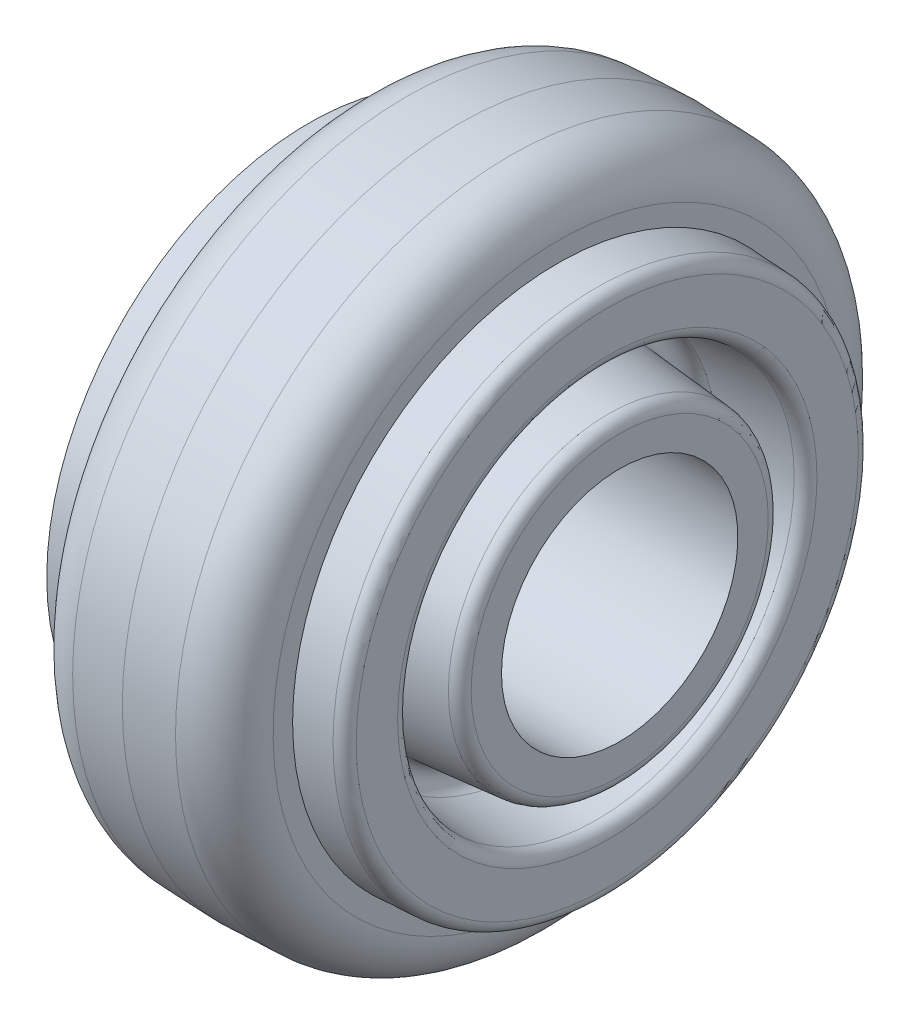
ISO-10303-21;
HEADER;
FILE_DESCRIPTION(('STEP AP214'),'2;1');
FILE_NAME('part.step','',(''),(''),'','','');
FILE_SCHEMA(('AUTOMOTIVE_DESIGN { 1 0 10303 214 1 1 1 1 }'));
ENDSEC;
DATA;
#1=APPLICATION_CONTEXT('core data for automotive mechanical design processes');
#2=APPLICATION_PROTOCOL_DEFINITION('international standard','automotive_design',2000,#1);
#3=PRODUCT_CONTEXT('',#1,'mechanical');
#4=PRODUCT('Part','Part','',(#3));
#5=PRODUCT_RELATED_PRODUCT_CATEGORY('part','',(#4));
#6=PRODUCT_DEFINITION_FORMATION('','',#4);
#7=PRODUCT_DEFINITION_CONTEXT('part definition',#1,'design');
#8=PRODUCT_DEFINITION('design','',#6,#7);
#9=PRODUCT_DEFINITION_SHAPE('','',#8);
#10=(LENGTH_UNIT() NAMED_UNIT(*) SI_UNIT(.MILLI.,.METRE.));
#11=(NAMED_UNIT(*) PLANE_ANGLE_UNIT() SI_UNIT($,.RADIAN.));
#12=(NAMED_UNIT(*) SI_UNIT($,.STERADIAN.) SOLID_ANGLE_UNIT());
#13=UNCERTAINTY_MEASURE_WITH_UNIT(LENGTH_MEASURE(1.E-05),#10,'distance_accuracy_value','');
#14=(GEOMETRIC_REPRESENTATION_CONTEXT(3) GLOBAL_UNCERTAINTY_ASSIGNED_CONTEXT((#13)) GLOBAL_UNIT_ASSIGNED_CONTEXT((#10,
#11,#12)) REPRESENTATION_CONTEXT('',''));
#15=CARTESIAN_POINT('',(0.,0.,0.));
#16=DIRECTION('',(0.,0.,1.));
#17=DIRECTION('',(1.,0.,0.));
#18=AXIS2_PLACEMENT_3D('',#15,#16,#17);
#19=CARTESIAN_POINT('',(0.,0.,0.));
#20=DIRECTION('',(-1.,0.,0.));
#21=DIRECTION('',(0.,-1.,0.));
#22=AXIS2_PLACEMENT_3D('',#19,#20,#21);
#23=CONICAL_SURFACE('',#22,42.926,0.034906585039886);
#24=CARTESIAN_POINT('',(6.57161180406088,0.,0.));
#25=DIRECTION('',(1.,0.,0.));
#26=DIRECTION('',(0.,1.,0.));
#27=AXIS2_PLACEMENT_3D('',#24,#25,#26);
#28=CIRCLE('',#27,42.6965142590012);
#29=CARTESIAN_POINT('',(6.57161180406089,42.6965142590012,0.));
#30=VERTEX_POINT('',#29);
#31=EDGE_CURVE('E204',#30,#30,#28,.T.);
#32=ORIENTED_EDGE('',*,*,#31,.F.);
#33=EDGE_LOOP('',(#32));
#34=FACE_BOUND('',#33,.T.);
#35=CARTESIAN_POINT('',(0.,0.,0.));
#36=DIRECTION('',(1.,0.,0.));
#37=DIRECTION('',(0.,0.,-1.));
#38=AXIS2_PLACEMENT_3D('',#35,#36,#37);
#39=CIRCLE('',#38,42.926);
#40=CARTESIAN_POINT('',(0.,0.,-42.926));
#41=VERTEX_POINT('',#40);
#42=EDGE_CURVE('E62',#41,#41,#39,.F.);
#43=ORIENTED_EDGE('',*,*,#42,.F.);
#44=EDGE_LOOP('',(#43));
#45=FACE_BOUND('',#44,.T.);
#46=ADVANCED_FACE('F16',(#34,#45),#23,.T.);
#47=CARTESIAN_POINT('',(0.,0.,0.));
#48=DIRECTION('',(1.,0.,0.));
#49=DIRECTION('',(0.,1.,0.));
#50=AXIS2_PLACEMENT_3D('',#47,#48,#49);
#51=CONICAL_SURFACE('',#50,42.926,0.034906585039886);
#52=CARTESIAN_POINT('',(-6.57161180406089,0.,0.));
#53=DIRECTION('',(-1.,0.,0.));
#54=DIRECTION('',(0.,-1.,0.));
#55=AXIS2_PLACEMENT_3D('',#52,#53,#54);
#56=CIRCLE('',#55,42.6965142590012);
#57=CARTESIAN_POINT('',(-6.57161180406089,-42.6965142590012,0.));
#58=VERTEX_POINT('',#57);
#59=EDGE_CURVE('E58',#58,#58,#56,.T.);
#60=ORIENTED_EDGE('',*,*,#59,.F.);
#61=EDGE_LOOP('',(#60));
#62=FACE_BOUND('',#61,.T.);
#63=ORIENTED_EDGE('',*,*,#42,.T.);
#64=EDGE_LOOP('',(#63));
#65=FACE_BOUND('',#64,.T.);
#66=ADVANCED_FACE('F194',(#62,#65),#51,.T.);
#67=CARTESIAN_POINT('',(6.35,0.,0.));
#68=DIRECTION('',(-1.,0.,0.));
#69=DIRECTION('',(0.,-1.,0.));
#70=AXIS2_PLACEMENT_3D('',#67,#68,#69);
#71=TOROIDAL_SURFACE('',#70,36.3503825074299,6.35);
#72=CARTESIAN_POINT('',(12.7,0.,0.));
#73=DIRECTION('',(-1.,0.,0.));
#74=DIRECTION('',(0.,-1.,0.));
#75=AXIS2_PLACEMENT_3D('',#72,#73,#74);
#76=CIRCLE('',#75,36.3503825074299);
#77=CARTESIAN_POINT('',(12.7,-36.3503825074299,0.));
#78=VERTEX_POINT('',#77);
#79=EDGE_CURVE('E20',#78,#78,#76,.F.);
#80=ORIENTED_EDGE('',*,*,#79,.F.);
#81=EDGE_LOOP('',(#80));
#82=FACE_BOUND('',#81,.T.);
#83=ORIENTED_EDGE('',*,*,#31,.T.);
#84=EDGE_LOOP('',(#83));
#85=FACE_BOUND('',#84,.T.);
#86=ADVANCED_FACE('F74',(#82,#85),#71,.T.);
#87=CARTESIAN_POINT('',(-6.35,0.,0.));
#88=DIRECTION('',(-1.,0.,0.));
#89=DIRECTION('',(0.,0.,1.));
#90=AXIS2_PLACEMENT_3D('',#87,#88,#89);
#91=TOROIDAL_SURFACE('',#90,36.3503825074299,6.35);
#92=ORIENTED_EDGE('',*,*,#59,.T.);
#93=EDGE_LOOP('',(#92));
#94=FACE_BOUND('',#93,.T.);
#95=CARTESIAN_POINT('',(-12.7,0.,36.3503825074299));
#96=CARTESIAN_POINT('',(-12.7,-0.371293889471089,36.3503844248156));
#97=CARTESIAN_POINT('',(-12.7,-0.742587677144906,36.344693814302));
#98=CARTESIAN_POINT('',(-12.7,-1.48482669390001,36.3219413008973));
#99=CARTESIAN_POINT('',(-12.7,-1.8557719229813,36.3048793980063));
#100=CARTESIAN_POINT('',(-12.7,-2.59696546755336,36.259398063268));
#101=CARTESIAN_POINT('',(-12.7,-2.96721378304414,36.2309786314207));
#102=CARTESIAN_POINT('',(-12.7,-3.70666588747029,36.1628095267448));
#103=CARTESIAN_POINT('',(-12.7,-4.07586967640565,36.1230598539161));
#104=CARTESIAN_POINT('',(-12.7,-4.81288607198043,36.0322674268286));
#105=CARTESIAN_POINT('',(-12.7,-5.18069867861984,35.9812246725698));
#106=CARTESIAN_POINT('',(-12.7,-5.91458736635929,35.8678940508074));
#107=CARTESIAN_POINT('',(-12.7,-6.28066344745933,35.8056061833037));
#108=CARTESIAN_POINT('',(-12.7,-7.01073536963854,35.6698438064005));
#109=CARTESIAN_POINT('',(-12.7,-7.3747312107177,35.5963692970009));
#110=CARTESIAN_POINT('',(-12.7,-8.10030089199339,35.4383026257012));
#111=CARTESIAN_POINT('',(-12.7,-8.46187473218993,35.3537104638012));
#112=CARTESIAN_POINT('',(-12.7,-9.18226092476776,35.1734879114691));
#113=CARTESIAN_POINT('',(-12.7,-9.54107327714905,35.0778575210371));
#114=CARTESIAN_POINT('',(-12.7,-10.2555996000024,34.8756483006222));
#115=CARTESIAN_POINT('',(-12.7,-10.6113135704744,34.7690694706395));
#116=CARTESIAN_POINT('',(-12.7,-11.3193091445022,34.545063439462));
#117=CARTESIAN_POINT('',(-12.7,-11.671590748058,34.4276362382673));
#118=CARTESIAN_POINT('',(-12.7,-12.3723908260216,34.1820437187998));
#119=CARTESIAN_POINT('',(-12.7,-12.7209093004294,34.0538784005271));
#120=CARTESIAN_POINT('',(-12.7,-13.4138558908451,33.7869299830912));
#121=CARTESIAN_POINT('',(-12.7,-13.7582840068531,33.6481468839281));
#122=CARTESIAN_POINT('',(-12.7,-14.442726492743,33.3600932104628));
#123=CARTESIAN_POINT('',(-12.7,-14.7827408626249,33.2108226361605));
#124=CARTESIAN_POINT('',(-12.7,-15.4580366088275,32.9019341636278));
#125=CARTESIAN_POINT('',(-12.7,-15.7933179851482,32.7423162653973));
#126=CARTESIAN_POINT('',(-12.7,-16.4588329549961,32.4128830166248));
#127=CARTESIAN_POINT('',(-12.6999999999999,-16.7890665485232,32.2430676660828));
#128=CARTESIAN_POINT('',(-12.7000000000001,-17.44417584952,31.8933989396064));
#129=CARTESIAN_POINT('',(-12.7000000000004,-17.7690515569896,31.713545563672));
#130=CARTESIAN_POINT('',(-12.6999999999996,-18.4131402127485,31.3439697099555));
#131=CARTESIAN_POINT('',(-12.6999999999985,-18.7323531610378,31.1542472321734));
#132=CARTESIAN_POINT('',(-12.7000000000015,-19.3648159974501,30.7651110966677));
#133=CARTESIAN_POINT('',(-12.7000000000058,-19.6780658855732,30.565697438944));
#134=CARTESIAN_POINT('',(-12.6999999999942,-20.2983106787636,30.1573669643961));
#135=CARTESIAN_POINT('',(-12.6999999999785,-20.6053055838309,29.9484501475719));
#136=CARTESIAN_POINT('',(-12.7000000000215,-21.2127439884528,29.5213065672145));
#137=CARTESIAN_POINT('',(-12.7000000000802,-21.5131874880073,29.3030798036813));
#138=CARTESIAN_POINT('',(-12.6999999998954,-22.1974851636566,28.7898743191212));
#139=CARTESIAN_POINT('',(-12.6999999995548,-22.5789594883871,28.4917142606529));
#140=CARTESIAN_POINT('',(-12.6999999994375,-23.3297193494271,27.8804216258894));
#141=CARTESIAN_POINT('',(-12.6999999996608,-23.6990048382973,27.5672889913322));
#142=CARTESIAN_POINT('',(-12.6999999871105,-24.2887640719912,27.0467571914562));
#143=CARTESIAN_POINT('',(-12.699999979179,-24.5131151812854,26.8437384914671));
#144=CARTESIAN_POINT('',(-12.6999999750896,-24.8052097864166,26.5725809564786));
#145=CARTESIAN_POINT('',(-12.6999999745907,-24.8753127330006,26.5069740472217));
#146=CARTESIAN_POINT('',(-12.6999999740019,-25.3368393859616,26.0715640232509));
#147=CARTESIAN_POINT('',(-12.6999999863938,-25.7202560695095,25.693202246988));
#148=CARTESIAN_POINT('',(-12.7000000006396,-26.5379708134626,24.8495720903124));
#149=CARTESIAN_POINT('',(-12.7000000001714,-26.9688652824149,24.3809987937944));
#150=CARTESIAN_POINT('',(-12.6999999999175,-27.5888221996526,23.6707052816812));
#151=CARTESIAN_POINT('',(-12.6999999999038,-27.7874728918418,23.437282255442));
#152=CARTESIAN_POINT('',(-12.6999999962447,-28.2282921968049,22.9058605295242));
#153=CARTESIAN_POINT('',(-12.6999999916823,-28.4687697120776,22.6064519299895));
#154=CARTESIAN_POINT('',(-12.6999999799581,-28.8601066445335,22.1030736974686));
#155=CARTESIAN_POINT('',(-12.6999999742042,-29.0136800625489,21.9012034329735));
#156=CARTESIAN_POINT('',(-12.6999999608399,-29.4246045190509,21.3490892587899));
#157=CARTESIAN_POINT('',(-12.6999999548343,-29.6778167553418,20.9957525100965));
#158=CARTESIAN_POINT('',(-12.6999999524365,-30.2600956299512,20.1514876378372));
#159=CARTESIAN_POINT('',(-12.6999999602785,-30.583692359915,19.6567764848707));
#160=CARTESIAN_POINT('',(-12.6999999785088,-31.17174343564,18.7079583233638));
#161=CARTESIAN_POINT('',(-12.6999999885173,-31.4387742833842,18.2554464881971));
#162=CARTESIAN_POINT('',(-12.6999999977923,-31.8243138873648,17.5682899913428));
#163=CARTESIAN_POINT('',(-12.6999999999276,-31.950328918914,17.3378338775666));
#164=CARTESIAN_POINT('',(-12.7000000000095,-32.0900303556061,17.0757378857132));
#165=CARTESIAN_POINT('',(-12.6999999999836,-32.1061513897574,17.0453908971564));
#166=CARTESIAN_POINT('',(-12.6999999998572,-32.1892485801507,16.8884417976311));
#167=CARTESIAN_POINT('',(-12.6999999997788,-32.2555380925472,16.7614751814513));
#168=CARTESIAN_POINT('',(-12.6999999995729,-32.4320628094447,16.4184420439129));
#169=CARTESIAN_POINT('',(-12.6999999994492,-32.5408916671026,16.2016506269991));
#170=CARTESIAN_POINT('',(-12.6999999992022,-32.7978689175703,15.6767196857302));
#171=CARTESIAN_POINT('',(-12.6999999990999,-32.9438691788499,15.3675268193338));
#172=CARTESIAN_POINT('',(-12.6999999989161,-33.2682323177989,14.654733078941));
#173=CARTESIAN_POINT('',(-12.6999999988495,-33.4436749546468,14.2498004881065));
#174=CARTESIAN_POINT('',(-12.6999999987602,-33.8175262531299,13.3419751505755));
#175=CARTESIAN_POINT('',(-12.699999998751,-34.0122150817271,12.8375492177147));
#176=CARTESIAN_POINT('',(-12.6999999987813,-34.4126017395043,11.7270414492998));
#177=CARTESIAN_POINT('',(-12.6999999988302,-34.6137507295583,11.119309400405));
#178=CARTESIAN_POINT('',(-12.6999999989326,-34.901956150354,10.1647898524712));
#179=CARTESIAN_POINT('',(-12.6999999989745,-35.0001606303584,9.82132266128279));
#180=CARTESIAN_POINT('',(-12.6999999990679,-35.1928811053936,9.10765821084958));
#181=CARTESIAN_POINT('',(-12.6999999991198,-35.286666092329,8.73726261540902));
#182=CARTESIAN_POINT('',(-12.69999999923,-35.4682276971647,7.96953504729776));
#183=CARTESIAN_POINT('',(-12.6999999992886,-35.5552175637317,7.57201709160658));
#184=CARTESIAN_POINT('',(-12.6999999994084,-35.7207039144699,6.7499386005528));
#185=CARTESIAN_POINT('',(-12.6999999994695,-35.7983580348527,6.32520828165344));
#186=CARTESIAN_POINT('',(-12.6999999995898,-35.942518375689,5.44874718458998));
#187=CARTESIAN_POINT('',(-12.6999999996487,-36.0081264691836,4.9968685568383));
#188=CARTESIAN_POINT('',(-12.6999999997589,-36.1253790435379,4.06632053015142));
#189=CARTESIAN_POINT('',(-12.6999999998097,-36.1760699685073,3.5875307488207));
#190=CARTESIAN_POINT('',(-12.6999999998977,-36.2605195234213,2.60357731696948));
#191=CARTESIAN_POINT('',(-12.6999999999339,-36.2932698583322,2.09832718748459));
#192=CARTESIAN_POINT('',(-12.6999999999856,-36.3387282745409,1.06207204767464));
#193=CARTESIAN_POINT('',(-12.7,-36.3503744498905,0.53101938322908));
#194=CARTESIAN_POINT('',(-12.7,-36.3503867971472,-0.282707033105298));
#195=CARTESIAN_POINT('',(-12.699999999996,-36.3470924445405,-0.565404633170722));
#196=CARTESIAN_POINT('',(-12.699999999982,-36.3339098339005,-1.13064557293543));
#197=CARTESIAN_POINT('',(-12.699999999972,-36.3240215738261,-1.41318891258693));
#198=CARTESIAN_POINT('',(-12.6999999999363,-36.2844712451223,-2.26035100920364));
#199=CARTESIAN_POINT('',(-12.6999999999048,-36.2449236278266,-2.82454013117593));
#200=CARTESIAN_POINT('',(-12.6999999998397,-36.1395542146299,-3.95043687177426));
#201=CARTESIAN_POINT('',(-12.6999999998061,-36.0737324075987,-4.51214448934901));
#202=CARTESIAN_POINT('',(-12.6999999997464,-35.915957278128,-5.63188400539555));
#203=CARTESIAN_POINT('',(-12.6999999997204,-35.8240039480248,-6.18991590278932));
#204=CARTESIAN_POINT('',(-12.6999999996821,-35.6141661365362,-7.30108114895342));
#205=CARTESIAN_POINT('',(-12.6999999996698,-35.4962816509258,-7.85421449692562));
#206=CARTESIAN_POINT('',(-12.6999999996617,-35.2348381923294,-8.95438049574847));
#207=CARTESIAN_POINT('',(-12.699999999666,-35.0912792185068,-9.50141314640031));
#208=CARTESIAN_POINT('',(-12.6999999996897,-34.7787992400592,-10.5881854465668));
#209=CARTESIAN_POINT('',(-12.6999999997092,-34.6098782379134,-11.1279250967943));
#210=CARTESIAN_POINT('',(-12.6999999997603,-34.2470425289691,-12.1989387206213));
#211=CARTESIAN_POINT('',(-12.6999999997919,-34.0531278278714,-12.7302126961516));
#212=CARTESIAN_POINT('',(-12.6999999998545,-33.6407250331,-13.7831291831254));
#213=CARTESIAN_POINT('',(-12.6999999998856,-33.4222369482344,-14.3047716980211));
#214=CARTESIAN_POINT('',(-12.6999999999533,-32.961170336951,-15.3373228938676));
#215=CARTESIAN_POINT('',(-12.6999999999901,-32.7185918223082,-15.8482315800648));
#216=CARTESIAN_POINT('',(-12.6999999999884,-32.3370235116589,-16.6056336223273));
#217=CARTESIAN_POINT('',(-12.6999999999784,-32.206879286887,-16.8566158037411));
#218=CARTESIAN_POINT('',(-12.7000000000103,-32.0105204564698,-17.2248600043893));
#219=CARTESIAN_POINT('',(-12.7000000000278,-31.9465234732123,-17.3433093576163));
#220=CARTESIAN_POINT('',(-12.6999999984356,-31.5677324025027,-18.0352162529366));
#221=CARTESIAN_POINT('',(-12.6999999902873,-31.2381117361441,-18.6006847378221));
#222=CARTESIAN_POINT('',(-12.6999999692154,-30.6090888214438,-19.6156123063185));
#223=CARTESIAN_POINT('',(-12.6999999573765,-30.314486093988,-20.0680621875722));
#224=CARTESIAN_POINT('',(-12.6999999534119,-29.8707358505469,-20.7172921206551));
#225=CARTESIAN_POINT('',(-12.6999999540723,-29.7294772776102,-20.9194859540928));
#226=CARTESIAN_POINT('',(-12.6999999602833,-29.5086198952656,-21.2287804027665));
#227=CARTESIAN_POINT('',(-12.69999996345,-29.4304816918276,-21.3369278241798));
#228=CARTESIAN_POINT('',(-12.6999999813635,-28.9659147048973,-21.9724879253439));
#229=CARTESIAN_POINT('',(-12.6999999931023,-28.5657255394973,-22.4899849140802));
#230=CARTESIAN_POINT('',(-12.700000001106,-27.8366953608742,-23.3820901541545));
#231=CARTESIAN_POINT('',(-12.7000000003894,-27.5135501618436,-23.761385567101));
#232=CARTESIAN_POINT('',(-12.6999999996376,-27.0097513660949,-24.3289009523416));
#233=CARTESIAN_POINT('',(-12.6999999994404,-26.8346005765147,-24.5220184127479));
#234=CARTESIAN_POINT('',(-12.6999999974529,-26.4929268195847,-24.8907050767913));
#235=CARTESIAN_POINT('',(-12.6999999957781,-26.3266882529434,-25.066538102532));
#236=CARTESIAN_POINT('',(-12.6999999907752,-25.822739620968,-25.5889874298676));
#237=CARTESIAN_POINT('',(-12.6999999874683,-25.4797818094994,-25.9305706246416));
#238=CARTESIAN_POINT('',(-12.6999999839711,-24.780474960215,-26.59972222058));
#239=CARTESIAN_POINT('',(-12.6999999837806,-24.4241258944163,-26.9272905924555));
#240=CARTESIAN_POINT('',(-12.6999999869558,-23.6986170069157,-27.5679221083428));
#241=CARTESIAN_POINT('',(-12.6999999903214,-23.3294572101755,-27.8809852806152));
#242=CARTESIAN_POINT('',(-12.6999999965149,-22.578834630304,-28.4920051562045));
#243=CARTESIAN_POINT('',(-12.6999999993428,-22.1973719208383,-28.7899619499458));
#244=CARTESIAN_POINT('',(-12.700000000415,-21.5657611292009,-29.2636492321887));
#245=CARTESIAN_POINT('',(-12.6999999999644,-21.3190279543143,-29.4439568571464));
#246=CARTESIAN_POINT('',(-12.6999999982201,-20.7829235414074,-29.8254312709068));
#247=CARTESIAN_POINT('',(-12.6999999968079,-20.4928116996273,-30.0255611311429));
#248=CARTESIAN_POINT('',(-12.699999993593,-20.0077947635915,-30.3498374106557));
#249=CARTESIAN_POINT('',(-12.6999999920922,-19.8145080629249,-30.4764166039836));
#250=CARTESIAN_POINT('',(-12.6999999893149,-19.261821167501,-30.8308391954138));
#251=CARTESIAN_POINT('',(-12.6999999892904,-18.8995505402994,-31.0542323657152));
#252=CARTESIAN_POINT('',(-12.6999999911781,-18.1661784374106,-31.488835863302));
#253=CARTESIAN_POINT('',(-12.6999999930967,-17.7950518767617,-31.700003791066));
#254=CARTESIAN_POINT('',(-12.6999999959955,-17.04559368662,-32.1091427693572));
#255=CARTESIAN_POINT('',(-12.6999999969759,-16.6672620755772,-32.3071138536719));
#256=CARTESIAN_POINT('',(-12.6999999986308,-15.9038529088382,-32.6895958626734));
#257=CARTESIAN_POINT('',(-12.6999999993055,-15.5187753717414,-32.8741068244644));
#258=CARTESIAN_POINT('',(-12.7000000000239,-14.7744965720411,-33.2147654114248));
#259=CARTESIAN_POINT('',(-12.7000000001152,-14.4157900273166,-33.3719967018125));
#260=CARTESIAN_POINT('',(-12.6999999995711,-13.6032081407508,-33.7127178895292));
#261=CARTESIAN_POINT('',(-12.6999999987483,-13.1479573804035,-33.8929469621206));
#262=CARTESIAN_POINT('',(-12.6999999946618,-12.4137668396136,-34.1665668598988));
#263=CARTESIAN_POINT('',(-12.6999999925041,-12.1370189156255,-34.2658941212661));
#264=CARTESIAN_POINT('',(-12.6999999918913,-11.4885243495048,-34.4897339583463));
#265=CARTESIAN_POINT('',(-12.69999999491,-11.1158588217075,-34.61160638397));
#266=CARTESIAN_POINT('',(-12.6999999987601,-10.55403453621,-34.785195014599));
#267=CARTESIAN_POINT('',(-12.6999999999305,-10.3662861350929,-34.8415219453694));
#268=CARTESIAN_POINT('',(-12.7000000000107,-10.1491526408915,-34.9048060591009));
#269=CARTESIAN_POINT('',(-12.6999999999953,-10.1201879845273,-34.9132098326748));
#270=CARTESIAN_POINT('',(-12.6999999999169,-9.9460721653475,-34.9634980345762));
#271=CARTESIAN_POINT('',(-12.6999999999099,-9.80067485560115,-35.0045334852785));
#272=CARTESIAN_POINT('',(-12.6999999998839,-9.39271949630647,-35.1169260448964));
#273=CARTESIAN_POINT('',(-12.6999999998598,-9.12959769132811,-35.1862439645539));
#274=CARTESIAN_POINT('',(-12.6999999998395,-8.4845153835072,-35.3484719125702));
#275=CARTESIAN_POINT('',(-12.6999999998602,-8.10174346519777,-35.438164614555));
#276=CARTESIAN_POINT('',(-12.6999999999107,-7.21523970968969,-35.6307794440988));
#277=CARTESIAN_POINT('',(-12.6999999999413,-6.71054023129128,-35.7292761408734));
#278=CARTESIAN_POINT('',(-12.699999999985,-5.74581987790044,-35.8963926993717));
#279=CARTESIAN_POINT('',(-12.6999999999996,-5.28613619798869,-35.9669677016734));
#280=CARTESIAN_POINT('',(-12.7000000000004,-4.44457665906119,-36.0796895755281));
#281=CARTESIAN_POINT('',(-12.6999999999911,-4.06307578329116,-36.1246460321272));
#282=CARTESIAN_POINT('',(-12.699999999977,-3.37526706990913,-36.1946620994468));
#283=CARTESIAN_POINT('',(-12.6999999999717,-3.06917970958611,-36.221902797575));
#284=CARTESIAN_POINT('',(-12.6999999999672,-2.45641109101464,-36.2686124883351));
#285=CARTESIAN_POINT('',(-12.699999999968,-2.14972983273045,-36.2880814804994));
#286=CARTESIAN_POINT('',(-12.6999999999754,-1.53597256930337,-36.3192345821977));
#287=CARTESIAN_POINT('',(-12.699999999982,-1.22889656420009,-36.3309186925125));
#288=CARTESIAN_POINT('',(-12.6999999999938,-0.614547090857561,-36.3464956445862));
#289=CARTESIAN_POINT('',(-12.6999999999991,-0.307273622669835,-36.3503884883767));
#290=CARTESIAN_POINT('',(-12.7,0.,-36.3503825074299));
#291=B_SPLINE_CURVE_WITH_KNOTS('',3,(#95,#96,#97,#98,#99,#100,#101,#102,#103,#104,#105,#106,
#107,#108,#109,#110,#111,#112,#113,#114,#115,#116,#117,#118,#119,#120,#121,#122,#123,#124,#125,
#126,#127,#128,#129,#130,#131,#132,#133,#134,#135,#136,#137,#138,#139,#140,#141,#142,#143,#144,
#145,#146,#147,#148,#149,#150,#151,#152,#153,#154,#155,#156,#157,#158,#159,#160,#161,#162,#163,
#164,#165,#166,#167,#168,#169,#170,#171,#172,#173,#174,#175,#176,#177,#178,#179,#180,#181,#182,
#183,#184,#185,#186,#187,#188,#189,#190,#191,#192,#193,#194,#195,#196,#197,#198,#199,#200,#201,
#202,#203,#204,#205,#206,#207,#208,#209,#210,#211,#212,#213,#214,#215,#216,#217,#218,#219,#220,
#221,#222,#223,#224,#225,#226,#227,#228,#229,#230,#231,#232,#233,#234,#235,#236,#237,#238,#239,
#240,#241,#242,#243,#244,#245,#246,#247,#248,#249,#250,#251,#252,#253,#254,#255,#256,#257,#258,
#259,#260,#261,#262,#263,#264,#265,#266,#267,#268,#269,#270,#271,#272,#273,#274,#275,#276,#277,
#278,#279,#280,#281,#282,#283,#284,#285,#286,#287,#288,#289,#290),.UNSPECIFIED.,.F.,.F.,(4,2,2,
2,2,2,2,2,2,2,2,2,2,2,2,2,2,2,2,2,2,2,2,2,2,2,2,2,2,2,2,2,2,2,2,2,2,2,2,2,2,2,2,2,2,2,2,2,2,2,2,
2,2,2,2,2,2,2,2,2,2,2,2,2,2,2,2,2,2,2,2,2,2,2,2,2,2,2,2,2,2,2,2,2,2,2,2,2,2,2,2,2,2,2,2,2,2,4),
(0.,1.11383791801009,2.22767583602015,3.34151375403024,4.45535167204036,5.56918959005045,
6.68302750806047,7.79686542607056,8.91070334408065,10.0245412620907,11.1383791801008,
12.2522170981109,13.3660550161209,14.479892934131,15.5937308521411,16.7075687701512,
17.8214066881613,18.9352446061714,20.0490825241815,21.1629204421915,22.2767583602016,
23.3905962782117,24.8427142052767,26.2948377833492,27.2024573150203,27.4904985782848,
29.1059321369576,31.0147123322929,31.9341717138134,33.0860234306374,33.8469177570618,
35.150727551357,36.9234331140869,38.4991918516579,39.2871103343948,39.3901998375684,
39.8198796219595,40.5475535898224,41.5732092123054,42.8968291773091,44.5183913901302,
46.4378689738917,47.5094321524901,48.6554878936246,49.8760351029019,51.1710726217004,
52.5405992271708,53.9846136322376,55.5031144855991,57.0961003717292,57.9441829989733,
58.7922658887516,60.4883169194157,62.1843686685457,63.8804209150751,65.5764734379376,
67.2725260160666,68.9685784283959,70.6646304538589,72.3606818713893,74.0567324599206,
74.9048150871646,75.3087101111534,77.2711762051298,78.8903695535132,79.6302685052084,
80.0305327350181,81.9919481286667,83.4864090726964,84.2684956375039,84.9943842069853,
86.446094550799,87.8978079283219,89.3495184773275,90.8012203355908,91.7179248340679,
92.7750868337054,93.4681921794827,94.7447348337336,96.0254679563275,97.3061977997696,
98.586924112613,99.7616995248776,101.230135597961,102.112166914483,103.288184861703,
103.876210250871,103.966687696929,104.419907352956,105.236136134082,106.415353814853,
107.957531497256,109.352400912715,110.504628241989,111.426424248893,112.348220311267,
113.270016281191,114.191812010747),.UNSPECIFIED.);
#292=CARTESIAN_POINT('',(-12.7,0.,36.3503825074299));
#293=VERTEX_POINT('',#292);
#294=CARTESIAN_POINT('',(-12.7,0.,-36.3503825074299));
#295=VERTEX_POINT('',#294);
#296=EDGE_CURVE('E50',#293,#295,#291,.T.);
#297=ORIENTED_EDGE('',*,*,#296,.T.);
#298=CARTESIAN_POINT('',(-12.7,0.,-36.3503825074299));
#299=CARTESIAN_POINT('',(-12.7,0.371293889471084,-36.3503844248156));
#300=CARTESIAN_POINT('',(-12.7,0.742587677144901,-36.344693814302));
#301=CARTESIAN_POINT('',(-12.7,1.48482669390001,-36.3219413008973));
#302=CARTESIAN_POINT('',(-12.7,1.8557719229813,-36.3048793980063));
#303=CARTESIAN_POINT('',(-12.7,2.59696546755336,-36.259398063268));
#304=CARTESIAN_POINT('',(-12.7,2.96721378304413,-36.2309786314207));
#305=CARTESIAN_POINT('',(-12.7,3.70666588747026,-36.1628095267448));
#306=CARTESIAN_POINT('',(-12.7,4.07586967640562,-36.1230598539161));
#307=CARTESIAN_POINT('',(-12.7,4.81288607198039,-36.0322674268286));
#308=CARTESIAN_POINT('',(-12.7,5.1806986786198,-35.9812246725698));
#309=CARTESIAN_POINT('',(-12.7,5.91458736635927,-35.8678940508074));
#310=CARTESIAN_POINT('',(-12.7,6.28066344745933,-35.8056061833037));
#311=CARTESIAN_POINT('',(-12.7,7.01073536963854,-35.6698438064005));
#312=CARTESIAN_POINT('',(-12.7,7.3747312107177,-35.5963692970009));
#313=CARTESIAN_POINT('',(-12.7,8.10030089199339,-35.4383026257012));
#314=CARTESIAN_POINT('',(-12.7,8.46187473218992,-35.3537104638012));
#315=CARTESIAN_POINT('',(-12.7,9.18226092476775,-35.1734879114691));
#316=CARTESIAN_POINT('',(-12.7,9.54107327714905,-35.0778575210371));
#317=CARTESIAN_POINT('',(-12.7,10.2555996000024,-34.8756483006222));
#318=CARTESIAN_POINT('',(-12.7,10.6113135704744,-34.7690694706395));
#319=CARTESIAN_POINT('',(-12.7,11.3193091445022,-34.545063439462));
#320=CARTESIAN_POINT('',(-12.7,11.671590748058,-34.4276362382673));
#321=CARTESIAN_POINT('',(-12.7,12.3723908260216,-34.1820437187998));
#322=CARTESIAN_POINT('',(-12.7,12.7209093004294,-34.0538784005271));
#323=CARTESIAN_POINT('',(-12.7,13.4138558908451,-33.7869299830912));
#324=CARTESIAN_POINT('',(-12.7,13.7582840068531,-33.6481468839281));
#325=CARTESIAN_POINT('',(-12.7,14.442726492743,-33.3600932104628));
#326=CARTESIAN_POINT('',(-12.7,14.7827408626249,-33.2108226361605));
#327=CARTESIAN_POINT('',(-12.7,15.4580366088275,-32.9019341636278));
#328=CARTESIAN_POINT('',(-12.7,15.7933179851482,-32.7423162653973));
#329=CARTESIAN_POINT('',(-12.7,16.4588329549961,-32.4128830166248));
#330=CARTESIAN_POINT('',(-12.6999999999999,16.7890665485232,-32.2430676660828));
#331=CARTESIAN_POINT('',(-12.7000000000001,17.4441758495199,-31.8933989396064));
#332=CARTESIAN_POINT('',(-12.7000000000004,17.7690515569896,-31.713545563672));
#333=CARTESIAN_POINT('',(-12.6999999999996,18.4131402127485,-31.3439697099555));
#334=CARTESIAN_POINT('',(-12.6999999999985,18.7323531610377,-31.1542472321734));
#335=CARTESIAN_POINT('',(-12.7000000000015,19.3648159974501,-30.7651110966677));
#336=CARTESIAN_POINT('',(-12.7000000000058,19.6780658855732,-30.5656974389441));
#337=CARTESIAN_POINT('',(-12.6999999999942,20.2983106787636,-30.1573669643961));
#338=CARTESIAN_POINT('',(-12.6999999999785,20.6053055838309,-29.9484501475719));
#339=CARTESIAN_POINT('',(-12.7000000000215,21.2127439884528,-29.5213065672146));
#340=CARTESIAN_POINT('',(-12.7000000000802,21.5131874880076,-29.3030798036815));
#341=CARTESIAN_POINT('',(-12.6999999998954,22.1974851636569,-28.7898743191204));
#342=CARTESIAN_POINT('',(-12.6999999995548,22.5789594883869,-28.4917142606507));
#343=CARTESIAN_POINT('',(-12.6999999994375,23.3297193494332,-27.8804216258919));
#344=CARTESIAN_POINT('',(-12.6999999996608,23.6990048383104,-27.5672889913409));
#345=CARTESIAN_POINT('',(-12.6999999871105,24.2887640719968,-27.0467571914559));
#346=CARTESIAN_POINT('',(-12.699999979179,24.5131151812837,-26.8437384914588));
#347=CARTESIAN_POINT('',(-12.6999999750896,24.8052098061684,-26.5725809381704));
#348=CARTESIAN_POINT('',(-12.6999999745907,24.8753127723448,-26.5069740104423));
#349=CARTESIAN_POINT('',(-12.6999999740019,25.3368394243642,-26.0715639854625));
#350=CARTESIAN_POINT('',(-12.6999999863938,25.7202560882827,-25.6932022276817));
#351=CARTESIAN_POINT('',(-12.7000000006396,26.5379708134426,-24.849572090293));
#352=CARTESIAN_POINT('',(-12.7000000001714,26.9688652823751,-24.3809987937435));
#353=CARTESIAN_POINT('',(-12.6999999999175,27.5888221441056,-23.6707053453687));
#354=CARTESIAN_POINT('',(-12.6999999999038,27.787472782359,-23.4372823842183));
#355=CARTESIAN_POINT('',(-12.6999999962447,28.228292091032,-22.9058606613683));
#356=CARTESIAN_POINT('',(-12.6999999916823,28.4687696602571,-22.6064519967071));
#357=CARTESIAN_POINT('',(-12.6999999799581,28.8601066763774,-22.1030736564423));
#358=CARTESIAN_POINT('',(-12.6999999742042,29.0136801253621,-21.9012033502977));
#359=CARTESIAN_POINT('',(-12.6999999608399,29.4246045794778,-21.3490891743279));
#360=CARTESIAN_POINT('',(-12.6999999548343,29.6778167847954,-20.9957524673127));
#361=CARTESIAN_POINT('',(-12.6999999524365,30.2600956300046,-20.1514876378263));
#362=CARTESIAN_POINT('',(-12.6999999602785,30.5836923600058,-19.6567764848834));
#363=CARTESIAN_POINT('',(-12.6999999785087,31.1717434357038,-18.7079583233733));
#364=CARTESIAN_POINT('',(-12.6999999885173,31.4387742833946,-18.2554464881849));
#365=CARTESIAN_POINT('',(-12.6999999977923,31.8243138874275,-17.5682899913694));
#366=CARTESIAN_POINT('',(-12.6999999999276,31.9503289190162,-17.3378338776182));
#367=CARTESIAN_POINT('',(-12.7000000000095,32.0900303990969,-17.0757378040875));
#368=CARTESIAN_POINT('',(-12.6999999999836,32.1061514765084,-17.0453907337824));
#369=CARTESIAN_POINT('',(-12.6999999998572,32.1892487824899,-16.8884414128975));
#370=CARTESIAN_POINT('',(-12.6999999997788,32.2555383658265,-16.7614746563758));
#371=CARTESIAN_POINT('',(-12.6999999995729,32.4320632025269,-16.418441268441));
#372=CARTESIAN_POINT('',(-12.6999999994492,32.5408921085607,-16.20164974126));
#373=CARTESIAN_POINT('',(-12.6999999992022,32.797869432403,-15.6767186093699));
#374=CARTESIAN_POINT('',(-12.6999999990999,32.9438697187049,-15.3675256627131));
#375=CARTESIAN_POINT('',(-12.6999999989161,33.2682328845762,-14.6547317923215));
#376=CARTESIAN_POINT('',(-12.6999999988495,33.4436755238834,-14.2497991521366));
#377=CARTESIAN_POINT('',(-12.6999999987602,33.8175268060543,-13.3419737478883));
#378=CARTESIAN_POINT('',(-12.699999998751,34.0122156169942,-12.8375477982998));
#379=CARTESIAN_POINT('',(-12.6999999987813,34.4126022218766,-11.7270400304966));
#380=CARTESIAN_POINT('',(-12.6999999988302,34.6137511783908,-11.1193079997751));
#381=CARTESIAN_POINT('',(-12.6999999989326,34.9019565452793,-10.1647884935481));
#382=CARTESIAN_POINT('',(-12.6999999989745,35.0001610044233,-9.82132132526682));
#383=CARTESIAN_POINT('',(-12.6999999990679,35.1928814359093,-9.10765693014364));
#384=CARTESIAN_POINT('',(-12.6999999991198,35.2866664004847,-8.73726136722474));
#385=CARTESIAN_POINT('',(-12.69999999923,35.4682279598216,-7.96953387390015));
#386=CARTESIAN_POINT('',(-12.6999999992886,35.5552178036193,-7.57201596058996));
#387=CARTESIAN_POINT('',(-12.6999999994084,35.7207041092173,-6.74993756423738));
#388=CARTESIAN_POINT('',(-12.6999999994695,35.7983582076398,-6.32520729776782));
#389=CARTESIAN_POINT('',(-12.6999999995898,35.9425185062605,-5.4487463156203));
#390=CARTESIAN_POINT('',(-12.6999999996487,36.0081265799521,-4.99686775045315));
#391=CARTESIAN_POINT('',(-12.6999999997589,36.1253791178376,-4.06631985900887));
#392=CARTESIAN_POINT('',(-12.6999999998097,36.1760700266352,-3.58753015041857));
#393=CARTESIAN_POINT('',(-12.6999999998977,36.2605195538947,-2.60357687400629));
#394=CARTESIAN_POINT('',(-12.6999999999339,36.2932698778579,-2.09832682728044));
#395=CARTESIAN_POINT('',(-12.6999999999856,36.3387282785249,-1.06207186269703));
#396=CARTESIAN_POINT('',(-12.7,36.3503744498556,-0.531019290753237));
#397=CARTESIAN_POINT('',(-12.7,36.3503867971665,0.2827070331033));
#398=CARTESIAN_POINT('',(-12.699999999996,36.3470924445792,0.565404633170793));
#399=CARTESIAN_POINT('',(-12.699999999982,36.3339098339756,1.13064557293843));
#400=CARTESIAN_POINT('',(-12.699999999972,36.3240215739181,1.41318891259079));
#401=CARTESIAN_POINT('',(-12.6999999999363,36.2844712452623,2.26035100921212));
#402=CARTESIAN_POINT('',(-12.6999999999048,36.2449236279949,2.82454013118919));
#403=CARTESIAN_POINT('',(-12.6999999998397,36.1395542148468,3.95043687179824));
#404=CARTESIAN_POINT('',(-12.6999999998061,36.073732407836,4.51214448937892));
#405=CARTESIAN_POINT('',(-12.6999999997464,35.9159572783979,5.63188400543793));
#406=CARTESIAN_POINT('',(-12.6999999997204,35.8240039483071,6.18991590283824));
#407=CARTESIAN_POINT('',(-12.6999999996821,35.6141661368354,7.30108114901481));
#408=CARTESIAN_POINT('',(-12.6999999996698,35.4962816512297,7.85421449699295));
#409=CARTESIAN_POINT('',(-12.6999999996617,35.2348381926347,8.95438049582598));
#410=CARTESIAN_POINT('',(-12.699999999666,35.0912792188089,9.50141314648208));
#411=CARTESIAN_POINT('',(-12.6999999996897,34.7787992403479,10.5881854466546));
#412=CARTESIAN_POINT('',(-12.6999999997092,34.6098782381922,11.127925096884));
#413=CARTESIAN_POINT('',(-12.6999999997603,34.2470425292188,12.19893872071));
#414=CARTESIAN_POINT('',(-12.6999999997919,34.0531278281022,12.7302126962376));
#415=CARTESIAN_POINT('',(-12.6999999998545,33.6407250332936,13.7831291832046));
#416=CARTESIAN_POINT('',(-12.6999999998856,33.4222369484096,14.3047716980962));
#417=CARTESIAN_POINT('',(-12.6999999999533,32.9611703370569,15.3373228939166));
#418=CARTESIAN_POINT('',(-12.6999999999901,32.7185918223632,15.8482315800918));
#419=CARTESIAN_POINT('',(-12.6999999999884,32.337023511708,16.6056336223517));
#420=CARTESIAN_POINT('',(-12.6999999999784,32.2068792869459,16.8566158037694));
#421=CARTESIAN_POINT('',(-12.7000000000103,32.0105203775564,17.2248601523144));
#422=CARTESIAN_POINT('',(-12.7000000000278,31.9465233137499,17.3433096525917));
#423=CARTESIAN_POINT('',(-12.6999999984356,31.5677322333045,18.0352165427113));
#424=CARTESIAN_POINT('',(-12.6999999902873,31.2381116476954,18.6006848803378));
#425=CARTESIAN_POINT('',(-12.6999999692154,30.6090888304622,19.6156122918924));
#426=CARTESIAN_POINT('',(-12.6999999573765,30.3144861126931,20.068062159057));
#427=CARTESIAN_POINT('',(-12.6999999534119,29.8707358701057,20.7172920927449));
#428=CARTESIAN_POINT('',(-12.6999999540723,29.7294772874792,20.9194859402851));
#429=CARTESIAN_POINT('',(-12.6999999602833,29.5086198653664,21.228780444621));
#430=CARTESIAN_POINT('',(-12.69999996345,29.4304816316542,21.3369279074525));
#431=CARTESIAN_POINT('',(-12.6999999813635,28.9659146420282,21.9724880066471));
#432=CARTESIAN_POINT('',(-12.6999999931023,28.565725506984,22.4899849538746));
#433=CARTESIAN_POINT('',(-12.700000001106,27.8366953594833,23.3820901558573));
#434=CARTESIAN_POINT('',(-12.7000000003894,27.5135501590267,23.7613855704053));
#435=CARTESIAN_POINT('',(-12.6999999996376,27.0097513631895,24.3289009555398));
#436=CARTESIAN_POINT('',(-12.6999999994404,26.8346005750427,24.5220184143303));
#437=CARTESIAN_POINT('',(-12.6999999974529,26.4929268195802,24.8907050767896));
#438=CARTESIAN_POINT('',(-12.6999999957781,26.3266882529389,25.0665381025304));
#439=CARTESIAN_POINT('',(-12.6999999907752,25.8227396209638,25.588987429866));
#440=CARTESIAN_POINT('',(-12.6999999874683,25.4797818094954,25.9305706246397));
#441=CARTESIAN_POINT('',(-12.6999999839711,24.7804749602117,26.5997222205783));
#442=CARTESIAN_POINT('',(-12.6999999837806,24.4241258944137,26.9272905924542));
#443=CARTESIAN_POINT('',(-12.6999999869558,23.698617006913,27.5679221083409));
#444=CARTESIAN_POINT('',(-12.6999999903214,23.3294572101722,27.8809852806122));
#445=CARTESIAN_POINT('',(-12.6999999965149,22.5788346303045,28.4920051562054));
#446=CARTESIAN_POINT('',(-12.6999999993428,22.1973719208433,28.7899619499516));
#447=CARTESIAN_POINT('',(-12.700000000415,21.565761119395,29.2636492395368));
#448=CARTESIAN_POINT('',(-12.6999999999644,21.319027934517,29.4439568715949));
#449=CARTESIAN_POINT('',(-12.6999999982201,20.7829235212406,29.8254312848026));
#450=CARTESIAN_POINT('',(-12.6999999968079,20.4928116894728,30.0255611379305));
#451=CARTESIAN_POINT('',(-12.699999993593,20.0077948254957,30.349837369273));
#452=CARTESIAN_POINT('',(-12.6999999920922,19.8145081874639,30.4764165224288));
#453=CARTESIAN_POINT('',(-12.6999999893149,19.2618212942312,30.8308391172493));
#454=CARTESIAN_POINT('',(-12.6999999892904,18.8995506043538,31.0542323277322));
#455=CARTESIAN_POINT('',(-12.6999999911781,18.1661784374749,31.4888358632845));
#456=CARTESIAN_POINT('',(-12.6999999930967,17.7950518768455,31.7000037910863));
#457=CARTESIAN_POINT('',(-12.6999999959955,17.0455936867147,32.109142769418));
#458=CARTESIAN_POINT('',(-12.6999999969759,16.6672620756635,32.3071138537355));
#459=CARTESIAN_POINT('',(-12.6999999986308,15.9038529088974,32.6895958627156));
#460=CARTESIAN_POINT('',(-12.6999999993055,15.518775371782,32.8741068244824));
#461=CARTESIAN_POINT('',(-12.7000000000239,14.7744965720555,33.2147654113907));
#462=CARTESIAN_POINT('',(-12.7000000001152,14.4157900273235,33.371996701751));
#463=CARTESIAN_POINT('',(-12.6999999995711,13.603208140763,33.7127178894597));
#464=CARTESIAN_POINT('',(-12.6999999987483,13.1479573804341,33.8929469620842));
#465=CARTESIAN_POINT('',(-12.6999999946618,12.413766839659,34.1665668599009));
#466=CARTESIAN_POINT('',(-12.6999999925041,12.13701891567,34.2658941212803));
#467=CARTESIAN_POINT('',(-12.6999999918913,11.488524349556,34.4897339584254));
#468=CARTESIAN_POINT('',(-12.69999999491,11.1158588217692,34.6116063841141));
#469=CARTESIAN_POINT('',(-12.6999999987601,10.5540345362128,34.7851950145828));
#470=CARTESIAN_POINT('',(-12.6999999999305,10.3662861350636,34.8415219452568));
#471=CARTESIAN_POINT('',(-12.7000000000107,10.1491527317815,34.9048060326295));
#472=CARTESIAN_POINT('',(-12.6999999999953,10.1201881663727,34.913209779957));
#473=CARTESIAN_POINT('',(-12.6999999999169,9.94607256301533,34.9634979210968));
#474=CARTESIAN_POINT('',(-12.6999999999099,9.80067537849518,35.0045333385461));
#475=CARTESIAN_POINT('',(-12.6999999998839,9.3927201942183,35.116925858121));
#476=CARTESIAN_POINT('',(-12.6999999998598,9.12959843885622,35.1862437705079));
#477=CARTESIAN_POINT('',(-12.6999999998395,8.48451615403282,35.3484717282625));
#478=CARTESIAN_POINT('',(-12.6999999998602,8.10174420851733,35.4381644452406));
#479=CARTESIAN_POINT('',(-12.6999999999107,7.2152403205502,35.6307793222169));
#480=CARTESIAN_POINT('',(-12.6999999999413,6.71054073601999,35.72927604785));
#481=CARTESIAN_POINT('',(-12.699999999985,5.74582014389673,35.8963926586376));
#482=CARTESIAN_POINT('',(-12.6999999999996,5.28613633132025,35.9669676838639));
#483=CARTESIAN_POINT('',(-12.7000000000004,4.4445766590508,36.0796895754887));
#484=CARTESIAN_POINT('',(-12.6999999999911,4.06307578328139,36.1246460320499));
#485=CARTESIAN_POINT('',(-12.699999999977,3.37526706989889,36.1946620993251));
#486=CARTESIAN_POINT('',(-12.6999999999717,3.06917970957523,36.221902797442));
#487=CARTESIAN_POINT('',(-12.6999999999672,2.45641109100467,36.2686124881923));
#488=CARTESIAN_POINT('',(-12.699999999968,2.14972983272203,36.288081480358));
#489=CARTESIAN_POINT('',(-12.6999999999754,1.5359725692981,36.3192345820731));
#490=CARTESIAN_POINT('',(-12.699999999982,1.2288965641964,36.3309186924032));
#491=CARTESIAN_POINT('',(-12.6999999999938,0.61454709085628,36.3464956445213));
#492=CARTESIAN_POINT('',(-12.6999999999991,0.307273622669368,36.350388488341));
#493=CARTESIAN_POINT('',(-12.7,0.,36.3503825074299));
#494=B_SPLINE_CURVE_WITH_KNOTS('',3,(#298,#299,#300,#301,#302,#303,#304,#305,#306,#307,#308,
#309,#310,#311,#312,#313,#314,#315,#316,#317,#318,#319,#320,#321,#322,#323,#324,#325,#326,#327,
#328,#329,#330,#331,#332,#333,#334,#335,#336,#337,#338,#339,#340,#341,#342,#343,#344,#345,#346,
#347,#348,#349,#350,#351,#352,#353,#354,#355,#356,#357,#358,#359,#360,#361,#362,#363,#364,#365,
#366,#367,#368,#369,#370,#371,#372,#373,#374,#375,#376,#377,#378,#379,#380,#381,#382,#383,#384,
#385,#386,#387,#388,#389,#390,#391,#392,#393,#394,#395,#396,#397,#398,#399,#400,#401,#402,#403,
#404,#405,#406,#407,#408,#409,#410,#411,#412,#413,#414,#415,#416,#417,#418,#419,#420,#421,#422,
#423,#424,#425,#426,#427,#428,#429,#430,#431,#432,#433,#434,#435,#436,#437,#438,#439,#440,#441,
#442,#443,#444,#445,#446,#447,#448,#449,#450,#451,#452,#453,#454,#455,#456,#457,#458,#459,#460,
#461,#462,#463,#464,#465,#466,#467,#468,#469,#470,#471,#472,#473,#474,#475,#476,#477,#478,#479,
#480,#481,#482,#483,#484,#485,#486,#487,#488,#489,#490,#491,#492,#493),.UNSPECIFIED.,.F.,.F.,(4,
2,2,2,2,2,2,2,2,2,2,2,2,2,2,2,2,2,2,2,2,2,2,2,2,2,2,2,2,2,2,2,2,2,2,2,2,2,2,2,2,2,2,2,2,2,2,2,2,
2,2,2,2,2,2,2,2,2,2,2,2,2,2,2,2,2,2,2,2,2,2,2,2,2,2,2,2,2,2,2,2,2,2,2,2,2,2,2,2,2,2,2,2,2,2,2,2,
4),(0.,1.11383791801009,2.22767583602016,3.34151375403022,4.45535167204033,5.56918959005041,
6.68302750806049,7.79686542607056,8.91070334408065,10.0245412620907,11.1383791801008,
12.2522170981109,13.366055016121,14.479892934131,15.5937308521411,16.7075687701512,
17.8214066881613,18.9352446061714,20.0490825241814,21.1629204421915,22.2767583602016,
23.3905962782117,24.8427142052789,26.2948377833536,27.2024573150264,27.4904986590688,
29.1059321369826,31.0147123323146,31.9341714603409,33.0860234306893,33.8469179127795,
35.1507275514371,36.923433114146,38.4991918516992,39.2871103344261,39.390200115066,
39.8198803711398,40.5475546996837,41.5732105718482,42.8968306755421,44.5183929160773,
46.4378704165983,47.5094335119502,48.6554891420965,49.8760362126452,51.1710735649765,
52.5405999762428,53.9846141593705,55.5031147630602,57.0961003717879,57.9441829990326,
58.7922658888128,60.488316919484,62.1843686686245,63.8804209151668,65.5764734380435,
67.272526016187,68.9685784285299,70.6646304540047,72.360681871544,74.0567324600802,
74.904815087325,75.3087106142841,77.2711762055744,78.8903695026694,79.6302685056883,
80.0305328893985,81.9919481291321,83.4864090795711,84.2684956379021,84.9943842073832,
86.4460945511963,87.8978079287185,89.3495184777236,90.8012203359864,91.7179248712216,
92.7750868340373,93.4681919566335,94.7447348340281,96.0254679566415,97.3061978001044,
98.586924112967,99.7616995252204,101.23013559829,102.112166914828,103.288184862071,
103.876210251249,103.966687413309,104.419906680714,105.236135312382,106.415353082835,
107.957531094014,109.352400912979,110.504628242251,111.426424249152,112.348220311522,
113.270016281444,114.191812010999),.UNSPECIFIED.);
#495=EDGE_CURVE('E48',#295,#293,#494,.T.);
#496=ORIENTED_EDGE('',*,*,#495,.T.);
#497=EDGE_LOOP('',(#297,#496));
#498=FACE_BOUND('',#497,.T.);
#499=ADVANCED_FACE('F55',(#94,#498),#91,.T.);
#500=CARTESIAN_POINT('',(12.7,36.3503825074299,0.));
#501=DIRECTION('',(1.,0.,0.));
#502=DIRECTION('',(0.,0.,-1.));
#503=AXIS2_PLACEMENT_3D('',#500,#501,#502);
#504=PLANE('',#503);
#505=CARTESIAN_POINT('',(12.7,0.,0.));
#506=DIRECTION('',(-1.,0.,0.));
#507=DIRECTION('',(0.,0.,1.));
#508=AXIS2_PLACEMENT_3D('',#505,#506,#507);
#509=CIRCLE('',#508,33.8607893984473);
#510=CARTESIAN_POINT('',(12.7,0.,33.8607893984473));
#511=VERTEX_POINT('',#510);
#512=EDGE_CURVE('E53',#511,#511,#509,.F.);
#513=ORIENTED_EDGE('',*,*,#512,.F.);
#514=EDGE_LOOP('',(#513));
#515=FACE_BOUND('',#514,.T.);
#516=ORIENTED_EDGE('',*,*,#79,.T.);
#517=EDGE_LOOP('',(#516));
#518=FACE_BOUND('',#517,.T.);
#519=ADVANCED_FACE('F79',(#515,#518),#504,.T.);
#520=CARTESIAN_POINT('',(-12.7,36.3503825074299,0.));
#521=DIRECTION('',(1.,0.,0.));
#522=DIRECTION('',(0.,0.,-1.));
#523=AXIS2_PLACEMENT_3D('',#520,#521,#522);
#524=PLANE('',#523);
#525=CARTESIAN_POINT('',(-12.7,0.,0.));
#526=DIRECTION('',(1.,0.,0.));
#527=DIRECTION('',(0.,0.,-1.));
#528=AXIS2_PLACEMENT_3D('',#525,#526,#527);
#529=CIRCLE('',#528,33.8607893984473);
#530=CARTESIAN_POINT('',(-12.7,0.,-33.8607893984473));
#531=VERTEX_POINT('',#530);
#532=EDGE_CURVE('E215',#531,#531,#529,.F.);
#533=ORIENTED_EDGE('',*,*,#532,.F.);
#534=EDGE_LOOP('',(#533));
#535=FACE_BOUND('',#534,.T.);
#536=ORIENTED_EDGE('',*,*,#495,.F.);
#537=ORIENTED_EDGE('',*,*,#296,.F.);
#538=EDGE_LOOP('',(#536,#537));
#539=FACE_BOUND('',#538,.T.);
#540=ADVANCED_FACE('F51',(#535,#539),#524,.F.);
#541=CARTESIAN_POINT('',(12.7000000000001,0.,0.));
#542=DIRECTION('',(-1.,0.,0.));
#543=DIRECTION('',(0.,0.,1.));
#544=AXIS2_PLACEMENT_3D('',#541,#542,#543);
#545=CONICAL_SURFACE('',#544,33.8607893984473,0.0523598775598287);
#546=ORIENTED_EDGE('',*,*,#512,.T.);
#547=EDGE_LOOP('',(#546));
#548=FACE_BOUND('',#547,.T.);
#549=CARTESIAN_POINT('',(17.6057599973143,0.,0.));
#550=DIRECTION('',(1.,0.,0.));
#551=DIRECTION('',(0.,0.,-1.));
#552=AXIS2_PLACEMENT_3D('',#549,#550,#551);
#553=CIRCLE('',#552,33.6036894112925);
#554=CARTESIAN_POINT('',(17.6057599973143,0.,-33.6036894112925));
#555=VERTEX_POINT('',#554);
#556=EDGE_CURVE('E212',#555,#555,#553,.T.);
#557=ORIENTED_EDGE('',*,*,#556,.F.);
#558=EDGE_LOOP('',(#557));
#559=FACE_BOUND('',#558,.T.);
#560=ADVANCED_FACE('F183',(#548,#559),#545,.T.);
#561=CARTESIAN_POINT('',(-12.7000000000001,0.,0.));
#562=DIRECTION('',(1.,0.,0.));
#563=DIRECTION('',(0.,0.,-1.));
#564=AXIS2_PLACEMENT_3D('',#561,#562,#563);
#565=CONICAL_SURFACE('',#564,33.8607893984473,0.0523598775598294);
#566=ORIENTED_EDGE('',*,*,#532,.T.);
#567=EDGE_LOOP('',(#566));
#568=FACE_BOUND('',#567,.T.);
#569=CARTESIAN_POINT('',(-19.05,0.,0.));
#570=DIRECTION('',(1.,0.,0.));
#571=DIRECTION('',(0.,0.,-1.));
#572=AXIS2_PLACEMENT_3D('',#569,#570,#571);
#573=CIRCLE('',#572,33.528);
#574=CARTESIAN_POINT('',(-19.05,0.,-33.528));
#575=VERTEX_POINT('',#574);
#576=EDGE_CURVE('E91',#575,#575,#573,.F.);
#577=ORIENTED_EDGE('',*,*,#576,.F.);
#578=EDGE_LOOP('',(#577));
#579=FACE_BOUND('',#578,.T.);
#580=ADVANCED_FACE('F180',(#568,#579),#565,.T.);
#581=CARTESIAN_POINT('',(17.526,0.,0.));
#582=DIRECTION('',(-1.,0.,0.));
#583=DIRECTION('',(0.,0.,1.));
#584=AXIS2_PLACEMENT_3D('',#581,#582,#583);
#585=TOROIDAL_SURFACE('',#584,32.0817780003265,1.52400000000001);
#586=ORIENTED_EDGE('',*,*,#556,.T.);
#587=EDGE_LOOP('',(#586));
#588=FACE_BOUND('',#587,.T.);
#589=CARTESIAN_POINT('',(19.05,0.,32.0817780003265));
#590=CARTESIAN_POINT('',(19.05,0.327693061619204,32.0817796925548));
#591=CARTESIAN_POINT('',(19.05,0.655386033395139,32.0767573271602));
#592=CARTESIAN_POINT('',(19.05,1.3104643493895,32.0566766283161));
#593=CARTESIAN_POINT('',(19.05,1.63784969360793,32.0416182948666));
#594=CARTESIAN_POINT('',(19.05,2.29200530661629,32.0014778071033));
#595=CARTESIAN_POINT('',(19.05,2.61877557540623,31.9763956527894));
#596=CARTESIAN_POINT('',(19.05,3.27139424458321,31.916231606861));
#597=CARTESIAN_POINT('',(19.05,3.59724264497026,31.8811497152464));
#598=CARTESIAN_POINT('',(19.05,4.24771162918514,31.801018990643));
#599=CARTESIAN_POINT('',(19.05,4.57233221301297,31.7559701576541));
#600=CARTESIAN_POINT('',(19.05,5.22004077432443,31.6559478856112));
#601=CARTESIAN_POINT('',(19.05,5.54312875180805,31.6009744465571));
#602=CARTESIAN_POINT('',(19.05,6.18746874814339,31.4811545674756));
#603=CARTESIAN_POINT('',(19.05,6.50872076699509,31.4163081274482));
#604=CARTESIAN_POINT('',(19.05,7.14908721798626,31.2768031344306));
#605=CARTESIAN_POINT('',(19.05,7.46820165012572,31.2021445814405));
#606=CARTESIAN_POINT('',(19.05,8.10399330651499,31.0430854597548));
#607=CARTESIAN_POINT('',(19.05,8.4206705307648,30.9586848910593));
#608=CARTESIAN_POINT('',(19.05,9.05129043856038,30.7802209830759));
#609=CARTESIAN_POINT('',(19.05,9.36523312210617,30.686157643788));
#610=CARTESIAN_POINT('',(19.05,9.990089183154,30.488456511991));
#611=CARTESIAN_POINT('',(19.05,10.3010025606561,30.384818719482));
#612=CARTESIAN_POINT('',(19.05,10.9195080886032,30.1680659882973));
#613=CARTESIAN_POINT('',(19.05,11.2271002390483,30.0549510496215));
#614=CARTESIAN_POINT('',(19.05,11.8386745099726,29.8193502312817));
#615=CARTESIAN_POINT('',(19.05,12.1426566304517,29.6968643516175));
#616=CARTESIAN_POINT('',(19.05,12.7467254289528,29.4426366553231));
#617=CARTESIAN_POINT('',(19.05,13.0468121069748,29.3108948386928));
#618=CARTESIAN_POINT('',(19.05,13.6428082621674,29.0382789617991));
#619=CARTESIAN_POINT('',(19.0500000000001,13.9387177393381,28.8974049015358));
#620=CARTESIAN_POINT('',(19.0499999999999,14.5260816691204,28.6066568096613));
#621=CARTESIAN_POINT('',(19.0499999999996,14.8175361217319,28.4567827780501));
#622=CARTESIAN_POINT('',(19.0500000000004,15.3957163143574,28.1481754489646));
#623=CARTESIAN_POINT('',(19.0500000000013,15.6824420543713,27.9894421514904));
#624=CARTESIAN_POINT('',(19.0499999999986,16.250895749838,27.6632653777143));
#625=CARTESIAN_POINT('',(19.0499999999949,16.5326237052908,27.4958219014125));
#626=CARTESIAN_POINT('',(19.050000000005,17.0908167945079,27.1523817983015));
#627=CARTESIAN_POINT('',(19.0500000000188,17.3672819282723,26.9763851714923));
#628=CARTESIAN_POINT('',(19.0499999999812,17.9146917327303,26.6160047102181));
#629=CARTESIAN_POINT('',(19.0499999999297,18.1856364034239,26.4316208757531));
#630=CARTESIAN_POINT('',(19.0500000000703,18.7217436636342,26.0546365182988));
#631=CARTESIAN_POINT('',(19.0500000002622,18.9869062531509,25.8620359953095));
#632=CARTESIAN_POINT('',(19.0499999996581,19.5908459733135,25.4090969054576));
#633=CARTESIAN_POINT('',(19.0499999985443,19.9275227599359,25.1459506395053));
#634=CARTESIAN_POINT('',(19.0499999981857,20.5901167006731,24.606445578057));
#635=CARTESIAN_POINT('',(19.049999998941,20.9160338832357,24.3300868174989));
#636=CARTESIAN_POINT('',(19.0499999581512,21.436531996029,23.8706868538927));
#637=CARTESIAN_POINT('',(19.0499999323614,21.6345348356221,23.6915115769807));
#638=CARTESIAN_POINT('',(19.0499999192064,21.8921556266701,23.4523568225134));
#639=CARTESIAN_POINT('',(19.0499999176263,21.9538574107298,23.3946134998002));
#640=CARTESIAN_POINT('',(19.049999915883,22.3611973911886,23.0103405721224));
#641=CARTESIAN_POINT('',(19.0499999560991,22.6997606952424,22.6762482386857));
#642=CARTESIAN_POINT('',(19.0500000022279,23.4216209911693,21.9315114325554));
#643=CARTESIAN_POINT('',(19.050000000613,23.8019213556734,21.5179572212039));
#644=CARTESIAN_POINT('',(19.0499999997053,24.3487456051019,20.8914548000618));
#645=CARTESIAN_POINT('',(19.0499999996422,24.52374154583,20.685837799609));
#646=CARTESIAN_POINT('',(19.049999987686,24.9128137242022,20.216845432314));
#647=CARTESIAN_POINT('',(19.0499999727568,25.125375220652,19.9522070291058));
#648=CARTESIAN_POINT('',(19.0499999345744,25.4709640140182,19.5076752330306));
#649=CARTESIAN_POINT('',(19.0499999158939,25.606402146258,19.3296466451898));
#650=CARTESIAN_POINT('',(19.049999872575,25.9690782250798,18.842374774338));
#651=CARTESIAN_POINT('',(19.0499998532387,26.1926556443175,18.5303959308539));
#652=CARTESIAN_POINT('',(19.0499998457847,26.706657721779,17.7851282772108));
#653=CARTESIAN_POINT('',(19.0499998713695,26.9922595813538,17.3485039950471));
#654=CARTESIAN_POINT('',(19.0499999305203,27.5112608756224,16.5110954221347));
#655=CARTESIAN_POINT('',(19.0499999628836,27.7469346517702,16.1117192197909));
#656=CARTESIAN_POINT('',(19.0499999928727,28.0872040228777,15.505254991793));
#657=CARTESIAN_POINT('',(19.0499999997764,28.1984224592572,15.3018625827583));
#658=CARTESIAN_POINT('',(19.0500000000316,28.3228434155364,15.0684289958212));
#659=CARTESIAN_POINT('',(19.04999999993,28.338192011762,15.0395275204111));
#660=CARTESIAN_POINT('',(19.0499999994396,28.4145249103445,14.8952731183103));
#661=CARTESIAN_POINT('',(19.0499999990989,28.4748665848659,14.7795792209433));
#662=CARTESIAN_POINT('',(19.0499999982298,28.6337622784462,14.470338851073));
#663=CARTESIAN_POINT('',(19.0499999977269,28.7310627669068,14.276147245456));
#664=CARTESIAN_POINT('',(19.0499999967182,28.9597602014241,13.8079180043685));
#665=CARTESIAN_POINT('',(19.0499999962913,29.0892620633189,13.5329532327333));
#666=CARTESIAN_POINT('',(19.0499999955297,29.3762295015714,12.9004931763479));
#667=CARTESIAN_POINT('',(19.0499999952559,29.5311323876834,12.5418326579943));
#668=CARTESIAN_POINT('',(19.0499999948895,29.8606581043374,11.7388840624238));
#669=CARTESIAN_POINT('',(19.0499999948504,30.032026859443,11.2932593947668));
#670=CARTESIAN_POINT('',(19.049999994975,30.3840261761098,10.3131746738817));
#671=CARTESIAN_POINT('',(19.0499999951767,30.5606860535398,9.77727973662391));
#672=CARTESIAN_POINT('',(19.0499999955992,30.8136523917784,8.9359304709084));
#673=CARTESIAN_POINT('',(19.049999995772,30.8997850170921,8.63339033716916));
#674=CARTESIAN_POINT('',(19.0499999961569,31.0687477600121,8.0049649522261));
#675=CARTESIAN_POINT('',(19.0499999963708,31.1509412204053,7.67890771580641));
#676=CARTESIAN_POINT('',(19.0499999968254,31.3100053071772,7.00327241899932));
#677=CARTESIAN_POINT('',(19.0499999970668,31.3861911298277,6.65353320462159));
#678=CARTESIAN_POINT('',(19.0499999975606,31.5310771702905,5.93044526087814));
#679=CARTESIAN_POINT('',(19.0499999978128,31.5990445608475,5.55694950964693));
#680=CARTESIAN_POINT('',(19.0499999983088,31.7251847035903,4.78638867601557));
#681=CARTESIAN_POINT('',(19.0499999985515,31.7825764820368,4.38919564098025));
#682=CARTESIAN_POINT('',(19.049999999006,31.8851173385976,3.57142573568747));
#683=CARTESIAN_POINT('',(19.0499999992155,31.9294375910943,3.15074473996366));
#684=CARTESIAN_POINT('',(19.0499999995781,32.0032554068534,2.28636387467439));
#685=CARTESIAN_POINT('',(19.0499999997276,32.031876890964,1.84258923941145));
#686=CARTESIAN_POINT('',(19.0499999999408,32.071595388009,0.932560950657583));
#687=CARTESIAN_POINT('',(19.0499999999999,32.0817700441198,0.466266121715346));
#688=CARTESIAN_POINT('',(19.05,32.0817822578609,-0.249508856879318));
#689=CARTESIAN_POINT('',(19.0499999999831,32.0788752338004,-0.499009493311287));
#690=CARTESIAN_POINT('',(19.0499999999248,32.0672415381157,-0.997874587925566));
#691=CARTESIAN_POINT('',(19.0499999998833,32.0585148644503,-1.24723904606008));
#692=CARTESIAN_POINT('',(19.0499999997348,32.0236100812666,-1.99491949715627));
#693=CARTESIAN_POINT('',(19.0499999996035,31.9887072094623,-2.49285633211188));
#694=CARTESIAN_POINT('',(19.0499999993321,31.8957124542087,-3.48653992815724));
#695=CARTESIAN_POINT('',(19.049999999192,31.8376205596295,-3.98228668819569));
#696=CARTESIAN_POINT('',(19.0499999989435,31.6983736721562,-4.97053614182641));
#697=CARTESIAN_POINT('',(19.049999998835,31.6172186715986,-5.46303883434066));
#698=CARTESIAN_POINT('',(19.0499999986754,31.4320224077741,-6.44372088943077));
#699=CARTESIAN_POINT('',(19.0499999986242,31.3279811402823,-6.93190025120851));
#700=CARTESIAN_POINT('',(19.0499999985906,31.0972388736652,-7.90287464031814));
#701=CARTESIAN_POINT('',(19.0499999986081,30.9705378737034,-8.38566966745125));
#702=CARTESIAN_POINT('',(19.0499999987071,30.6947519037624,-9.34482306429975));
#703=CARTESIAN_POINT('',(19.0499999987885,30.5456669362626,-9.82118143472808));
#704=CARTESIAN_POINT('',(19.0499999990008,30.2254381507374,-10.7664265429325));
#705=CARTESIAN_POINT('',(19.0499999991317,30.0542943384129,-11.2353132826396));
#706=CARTESIAN_POINT('',(19.0499999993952,29.6903186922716,-12.1645861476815));
#707=CARTESIAN_POINT('',(19.0499999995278,29.4974868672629,-12.6249722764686));
#708=CARTESIAN_POINT('',(19.049999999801,29.0905619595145,-13.5362712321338));
#709=CARTESIAN_POINT('',(19.0499999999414,28.8764688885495,-13.9871840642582));
#710=CARTESIAN_POINT('',(19.0499999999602,28.5397060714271,-14.6556439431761));
#711=CARTESIAN_POINT('',(19.0499999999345,28.4248437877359,-14.8771530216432));
#712=CARTESIAN_POINT('',(19.0500000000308,28.2521823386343,-15.2009566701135));
#713=CARTESIAN_POINT('',(19.0500000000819,28.1963526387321,-15.3043057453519));
#714=CARTESIAN_POINT('',(19.0499999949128,27.8621254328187,-15.9149975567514));
#715=CARTESIAN_POINT('',(19.0499999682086,27.5705630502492,-16.4152496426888));
#716=CARTESIAN_POINT('',(19.0499998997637,27.0147735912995,-17.3120152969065));
#717=CARTESIAN_POINT('',(19.0499998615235,26.7548501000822,-17.7112108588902));
#718=CARTESIAN_POINT('',(19.0499998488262,26.3632182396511,-18.2842062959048));
#719=CARTESIAN_POINT('',(19.049999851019,26.2384644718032,-18.4627784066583));
#720=CARTESIAN_POINT('',(19.0499998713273,26.0443050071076,-18.7346838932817));
#721=CARTESIAN_POINT('',(19.0499998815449,25.9762041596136,-18.8289524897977));
#722=CARTESIAN_POINT('',(19.0499999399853,25.5662649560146,-19.3899384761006));
#723=CARTESIAN_POINT('',(19.0499999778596,25.2122036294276,-19.8478516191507));
#724=CARTESIAN_POINT('',(19.0500000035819,24.5681260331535,-20.6360039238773));
#725=CARTESIAN_POINT('',(19.0500000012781,24.2832107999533,-20.9704411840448));
#726=CARTESIAN_POINT('',(19.0499999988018,23.8385934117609,-21.471331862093));
#727=CARTESIAN_POINT('',(19.0499999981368,23.683728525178,-21.6420898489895));
#728=CARTESIAN_POINT('',(19.0499999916,23.381888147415,-21.9677946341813));
#729=CARTESIAN_POINT('',(19.0499999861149,23.2351703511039,-22.1229804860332));
#730=CARTESIAN_POINT('',(19.0499999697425,22.7903986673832,-22.5840810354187));
#731=CARTESIAN_POINT('',(19.0499999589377,22.4877132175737,-22.8855536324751));
#732=CARTESIAN_POINT('',(19.0499999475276,21.8705236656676,-23.4761292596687));
#733=CARTESIAN_POINT('',(19.0499999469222,21.556019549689,-23.7652322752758));
#734=CARTESIAN_POINT('',(19.0499999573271,20.9157051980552,-24.3306361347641));
#735=CARTESIAN_POINT('',(19.0499999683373,20.5898949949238,-24.6069370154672));
#736=CARTESIAN_POINT('',(19.04999998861,19.9274160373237,-25.1462052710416));
#737=CARTESIAN_POINT('',(19.0499999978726,19.5907473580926,-25.4091727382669));
#738=CARTESIAN_POINT('',(19.0500000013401,19.0338331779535,-25.8268408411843));
#739=CARTESIAN_POINT('',(19.0499999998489,18.8166108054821,-25.9855936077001));
#740=CARTESIAN_POINT('',(19.0499999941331,18.3434884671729,-26.3222965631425));
#741=CARTESIAN_POINT('',(19.0499999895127,18.0869140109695,-26.4993025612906));
#742=CARTESIAN_POINT('',(19.0499999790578,17.6584837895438,-26.7857457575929));
#743=CARTESIAN_POINT('',(19.0499999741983,17.4880689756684,-26.8973490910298));
#744=CARTESIAN_POINT('',(19.0499999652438,17.0002912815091,-27.2101606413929));
#745=CARTESIAN_POINT('',(19.0499999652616,16.680388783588,-27.4074317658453));
#746=CARTESIAN_POINT('',(19.0499999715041,16.0329582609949,-27.791105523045));
#747=CARTESIAN_POINT('',(19.0499999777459,15.7054117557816,-27.9774769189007));
#748=CARTESIAN_POINT('',(19.0499999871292,15.0439598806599,-28.3385726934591));
#749=CARTESIAN_POINT('',(19.0499999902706,14.7100545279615,-28.5132971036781));
#750=CARTESIAN_POINT('',(19.049999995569,14.0362902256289,-28.8508666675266));
#751=CARTESIAN_POINT('',(19.0499999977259,13.6964312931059,-29.013711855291));
#752=CARTESIAN_POINT('',(19.0500000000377,13.0395537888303,-29.3143680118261));
#753=CARTESIAN_POINT('',(19.0500000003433,12.7229718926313,-29.4531354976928));
#754=CARTESIAN_POINT('',(19.0499999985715,12.0058163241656,-29.7538438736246));
#755=CARTESIAN_POINT('',(19.0499999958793,11.6040286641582,-29.912906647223));
#756=CARTESIAN_POINT('',(19.0499999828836,10.956051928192,-30.1543954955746));
#757=CARTESIAN_POINT('',(19.0499999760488,10.7117971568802,-30.2420604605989));
#758=CARTESIAN_POINT('',(19.0499999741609,10.1394451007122,-30.439617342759));
#759=CARTESIAN_POINT('',(19.0499999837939,9.8105368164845,-30.5471790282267));
#760=CARTESIAN_POINT('',(19.0499999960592,9.31468262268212,-30.7003885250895));
#761=CARTESIAN_POINT('',(19.0499999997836,9.14898079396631,-30.7501033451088));
#762=CARTESIAN_POINT('',(19.0500000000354,8.95575774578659,-30.8064166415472));
#763=CARTESIAN_POINT('',(19.049999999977,8.92860747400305,-30.8142913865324));
#764=CARTESIAN_POINT('',(19.0499999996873,8.77117243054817,-30.8597339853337));
#765=CARTESIAN_POINT('',(19.0499999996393,8.6406640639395,-30.8965302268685));
#766=CARTESIAN_POINT('',(19.0499999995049,8.27756085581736,-30.9964220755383));
#767=CARTESIAN_POINT('',(19.0499999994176,8.044471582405,-31.0577265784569));
#768=CARTESIAN_POINT('',(19.0499999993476,7.47473971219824,-31.2007341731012));
#769=CARTESIAN_POINT('',(19.0499999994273,7.13739121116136,-31.2796329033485));
#770=CARTESIAN_POINT('',(19.0499999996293,6.3573003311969,-31.4488024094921));
#771=CARTESIAN_POINT('',(19.0499999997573,5.91371921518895,-31.5352297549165));
#772=CARTESIAN_POINT('',(19.0499999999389,5.06645072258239,-31.6818104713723));
#773=CARTESIAN_POINT('',(19.0499999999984,4.66306204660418,-31.7436981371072));
#774=CARTESIAN_POINT('',(19.0500000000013,3.92265275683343,-31.8428730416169));
#775=CARTESIAN_POINT('',(19.0499999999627,3.58595129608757,-31.882550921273));
#776=CARTESIAN_POINT('',(19.0499999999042,2.97891157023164,-31.9443457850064));
#777=CARTESIAN_POINT('',(19.0499999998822,2.7087678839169,-31.968387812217));
#778=CARTESIAN_POINT('',(19.0499999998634,2.16795631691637,-32.0096125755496));
#779=CARTESIAN_POINT('',(19.0499999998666,1.89728843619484,-32.0267953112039));
#780=CARTESIAN_POINT('',(19.0499999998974,1.35560428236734,-32.054289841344));
#781=CARTESIAN_POINT('',(19.0499999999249,1.08458800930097,-32.0646016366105));
#782=CARTESIAN_POINT('',(19.0499999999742,0.542381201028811,-32.0783486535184));
#783=CARTESIAN_POINT('',(19.049999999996,0.271190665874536,-32.0817838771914));
#784=CARTESIAN_POINT('',(19.05,0.,-32.0817780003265));
#785=B_SPLINE_CURVE_WITH_KNOTS('',3,(#589,#590,#591,#592,#593,#594,#595,#596,#597,#598,#599,
#600,#601,#602,#603,#604,#605,#606,#607,#608,#609,#610,#611,#612,#613,#614,#615,#616,#617,#618,
#619,#620,#621,#622,#623,#624,#625,#626,#627,#628,#629,#630,#631,#632,#633,#634,#635,#636,#637,
#638,#639,#640,#641,#642,#643,#644,#645,#646,#647,#648,#649,#650,#651,#652,#653,#654,#655,#656,
#657,#658,#659,#660,#661,#662,#663,#664,#665,#666,#667,#668,#669,#670,#671,#672,#673,#674,#675,
#676,#677,#678,#679,#680,#681,#682,#683,#684,#685,#686,#687,#688,#689,#690,#691,#692,#693,#694,
#695,#696,#697,#698,#699,#700,#701,#702,#703,#704,#705,#706,#707,#708,#709,#710,#711,#712,#713,
#714,#715,#716,#717,#718,#719,#720,#721,#722,#723,#724,#725,#726,#727,#728,#729,#730,#731,#732,
#733,#734,#735,#736,#737,#738,#739,#740,#741,#742,#743,#744,#745,#746,#747,#748,#749,#750,#751,
#752,#753,#754,#755,#756,#757,#758,#759,#760,#761,#762,#763,#764,#765,#766,#767,#768,#769,#770,
#771,#772,#773,#774,#775,#776,#777,#778,#779,#780,#781,#782,#783,#784),.UNSPECIFIED.,.F.,.F.,(4,
2,2,2,2,2,2,2,2,2,2,2,2,2,2,2,2,2,2,2,2,2,2,2,2,2,2,2,2,2,2,2,2,2,2,2,2,2,2,2,2,2,2,2,2,2,2,2,2,
2,2,2,2,2,2,2,2,2,2,2,2,2,2,2,2,2,2,2,2,2,2,2,2,2,2,2,2,2,2,2,2,2,2,2,2,2,2,2,2,2,2,2,2,2,2,2,2,
4),(0.,0.983040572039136,1.96608114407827,2.94912171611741,3.93216228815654,4.91520286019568,
5.89824343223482,6.88128400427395,7.86432457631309,8.84736514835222,9.83040572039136,
10.8134462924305,11.7964868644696,12.7795274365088,13.7625680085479,14.745608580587,
15.7286491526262,16.7116897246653,17.6947302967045,18.6777708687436,19.6608114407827,
20.6438520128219,21.9254437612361,23.2070321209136,24.0080579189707,24.2615777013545,
25.6880162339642,27.3726722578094,28.1826210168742,29.2007277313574,29.8717617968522,
31.0229671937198,32.5875299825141,33.9782553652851,34.6736472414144,34.7718198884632,
35.1632634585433,35.81483199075,36.7265144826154,37.8982958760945,39.3301570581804,
41.0220748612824,41.9656481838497,42.9742476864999,44.0478724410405,45.1865214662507,
46.3901937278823,47.6588881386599,48.9926035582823,50.3913387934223,51.1398315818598,
51.8883246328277,53.3852095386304,54.8820951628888,56.3789812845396,57.8758676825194,
59.3727541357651,60.8696404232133,62.3665263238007,63.8634116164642,65.3602960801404,
66.1087888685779,66.4611818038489,68.1972434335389,69.6258488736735,70.2793040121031,
70.6281844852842,72.363666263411,73.6813586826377,74.3728802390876,75.0135309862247,
76.2947726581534,77.5760158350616,78.8572553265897,80.1384859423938,80.9455670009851,
81.8805381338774,82.4916314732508,83.6188865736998,84.7492281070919,85.8795665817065,
87.009901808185,88.04671837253,89.3427054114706,90.121176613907,91.1591094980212,
91.6780871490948,91.7628947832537,92.1696733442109,92.892660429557,93.9318386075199,
95.2871831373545,96.5112138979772,97.5281358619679,98.3416859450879,99.1552360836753,
99.968786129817,100.7823359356),.UNSPECIFIED.);
#786=CARTESIAN_POINT('',(19.05,0.,32.0817780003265));
#787=VERTEX_POINT('',#786);
#788=CARTESIAN_POINT('',(19.05,0.,-32.0817780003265));
#789=VERTEX_POINT('',#788);
#790=EDGE_CURVE('E90',#787,#789,#785,.T.);
#791=ORIENTED_EDGE('',*,*,#790,.T.);
#792=CARTESIAN_POINT('',(19.05,0.,-32.0817780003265));
#793=CARTESIAN_POINT('',(19.05,-0.327693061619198,-32.0817796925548));
#794=CARTESIAN_POINT('',(19.05,-0.655386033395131,-32.0767573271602));
#795=CARTESIAN_POINT('',(19.05,-1.31046434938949,-32.0566766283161));
#796=CARTESIAN_POINT('',(19.05,-1.63784969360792,-32.0416182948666));
#797=CARTESIAN_POINT('',(19.05,-2.29200530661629,-32.0014778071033));
#798=CARTESIAN_POINT('',(19.05,-2.61877557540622,-31.9763956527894));
#799=CARTESIAN_POINT('',(19.05,-3.2713942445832,-31.916231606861));
#800=CARTESIAN_POINT('',(19.05,-3.59724264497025,-31.8811497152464));
#801=CARTESIAN_POINT('',(19.05,-4.24771162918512,-31.801018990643));
#802=CARTESIAN_POINT('',(19.05,-4.57233221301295,-31.7559701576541));
#803=CARTESIAN_POINT('',(19.05,-5.22004077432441,-31.6559478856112));
#804=CARTESIAN_POINT('',(19.05,-5.54312875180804,-31.6009744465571));
#805=CARTESIAN_POINT('',(19.05,-6.18746874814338,-31.4811545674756));
#806=CARTESIAN_POINT('',(19.05,-6.50872076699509,-31.4163081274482));
#807=CARTESIAN_POINT('',(19.05,-7.14908721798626,-31.2768031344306));
#808=CARTESIAN_POINT('',(19.05,-7.46820165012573,-31.2021445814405));
#809=CARTESIAN_POINT('',(19.05,-8.10399330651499,-31.0430854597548));
#810=CARTESIAN_POINT('',(19.05,-8.42067053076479,-30.9586848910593));
#811=CARTESIAN_POINT('',(19.05,-9.05129043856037,-30.7802209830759));
#812=CARTESIAN_POINT('',(19.05,-9.36523312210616,-30.686157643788));
#813=CARTESIAN_POINT('',(19.05,-9.990089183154,-30.488456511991));
#814=CARTESIAN_POINT('',(19.05,-10.301002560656,-30.384818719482));
#815=CARTESIAN_POINT('',(19.05,-10.9195080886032,-30.1680659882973));
#816=CARTESIAN_POINT('',(19.05,-11.2271002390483,-30.0549510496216));
#817=CARTESIAN_POINT('',(19.05,-11.8386745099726,-29.8193502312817));
#818=CARTESIAN_POINT('',(19.05,-12.1426566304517,-29.6968643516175));
#819=CARTESIAN_POINT('',(19.05,-12.7467254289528,-29.4426366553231));
#820=CARTESIAN_POINT('',(19.05,-13.0468121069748,-29.3108948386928));
#821=CARTESIAN_POINT('',(19.05,-13.6428082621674,-29.0382789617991));
#822=CARTESIAN_POINT('',(19.0500000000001,-13.9387177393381,-28.8974049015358));
#823=CARTESIAN_POINT('',(19.0499999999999,-14.5260816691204,-28.6066568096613));
#824=CARTESIAN_POINT('',(19.0499999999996,-14.8175361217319,-28.4567827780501));
#825=CARTESIAN_POINT('',(19.0500000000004,-15.3957163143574,-28.1481754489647));
#826=CARTESIAN_POINT('',(19.0500000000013,-15.6824420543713,-27.9894421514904));
#827=CARTESIAN_POINT('',(19.0499999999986,-16.250895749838,-27.6632653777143));
#828=CARTESIAN_POINT('',(19.0499999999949,-16.5326237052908,-27.4958219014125));
#829=CARTESIAN_POINT('',(19.050000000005,-17.0908167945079,-27.1523817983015));
#830=CARTESIAN_POINT('',(19.0500000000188,-17.3672819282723,-26.9763851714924));
#831=CARTESIAN_POINT('',(19.0499999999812,-17.9146917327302,-26.6160047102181));
#832=CARTESIAN_POINT('',(19.0499999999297,-18.1856364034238,-26.431620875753));
#833=CARTESIAN_POINT('',(19.0500000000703,-18.7217436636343,-26.0546365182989));
#834=CARTESIAN_POINT('',(19.0500000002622,-18.9869062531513,-25.8620359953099));
#835=CARTESIAN_POINT('',(19.0499999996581,-19.5908459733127,-25.4090969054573));
#836=CARTESIAN_POINT('',(19.0499999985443,-19.9275227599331,-25.1459506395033));
#837=CARTESIAN_POINT('',(19.0499999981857,-20.5901167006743,-24.6064455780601));
#838=CARTESIAN_POINT('',(19.049999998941,-20.9160338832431,-24.3300868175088));
#839=CARTESIAN_POINT('',(19.0499999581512,-21.4365319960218,-23.8706868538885));
#840=CARTESIAN_POINT('',(19.0499999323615,-21.6345348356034,-23.691511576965));
#841=CARTESIAN_POINT('',(19.0499999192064,-21.8921556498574,-23.4523568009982));
#842=CARTESIAN_POINT('',(19.0499999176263,-21.9538574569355,-23.3946134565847));
#843=CARTESIAN_POINT('',(19.049999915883,-22.3611974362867,-23.0103405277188));
#844=CARTESIAN_POINT('',(19.0499999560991,-22.6997607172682,-22.6762482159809));
#845=CARTESIAN_POINT('',(19.0500000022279,-23.4216209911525,-21.9315114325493));
#846=CARTESIAN_POINT('',(19.050000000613,-23.8019213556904,-21.5179572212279));
#847=CARTESIAN_POINT('',(19.0499999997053,-24.3487456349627,-20.891454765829));
#848=CARTESIAN_POINT('',(19.0499999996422,-24.523741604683,-20.6858377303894));
#849=CARTESIAN_POINT('',(19.049999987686,-24.9128137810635,-20.2168453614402));
#850=CARTESIAN_POINT('',(19.0499999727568,-25.1253752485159,-19.9522069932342));
#851=CARTESIAN_POINT('',(19.0499999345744,-25.4709639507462,-19.5076753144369));
#852=CARTESIAN_POINT('',(19.0499999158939,-25.6064020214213,-19.3296468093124));
#853=CARTESIAN_POINT('',(19.049999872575,-25.9690781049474,-18.842374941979));
#854=CARTESIAN_POINT('',(19.0499998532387,-26.1926555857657,-18.530396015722));
#855=CARTESIAN_POINT('',(19.0499998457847,-26.7066577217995,-17.7851282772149));
#856=CARTESIAN_POINT('',(19.0499998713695,-26.9922595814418,-17.3485039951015));
#857=CARTESIAN_POINT('',(19.0499999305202,-27.5112608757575,-16.5110954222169));
#858=CARTESIAN_POINT('',(19.0499999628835,-27.7469346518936,-16.1117192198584));
#859=CARTESIAN_POINT('',(19.0499999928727,-28.0872040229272,-15.5052549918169));
#860=CARTESIAN_POINT('',(19.0499999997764,-28.1984224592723,-15.301862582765));
#861=CARTESIAN_POINT('',(19.0500000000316,-28.3228434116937,-15.0684290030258));
#862=CARTESIAN_POINT('',(19.04999999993,-28.3381920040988,-15.039527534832));
#863=CARTESIAN_POINT('',(19.0499999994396,-28.4145248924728,-14.8952731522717));
#864=CARTESIAN_POINT('',(19.0499999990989,-28.4748665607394,-14.779579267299));
#865=CARTESIAN_POINT('',(19.0499999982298,-28.6337622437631,-14.4703389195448));
#866=CARTESIAN_POINT('',(19.0499999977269,-28.7310627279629,-14.2761473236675));
#867=CARTESIAN_POINT('',(19.0499999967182,-28.9597601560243,-13.8079180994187));
#868=CARTESIAN_POINT('',(19.0499999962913,-29.0892620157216,-13.532953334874));
#869=CARTESIAN_POINT('',(19.0499999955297,-29.3762294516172,-12.9004932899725));
#870=CARTESIAN_POINT('',(19.0499999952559,-29.5311323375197,-12.5418327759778));
#871=CARTESIAN_POINT('',(19.0499999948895,-29.860658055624,-11.7388841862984));
#872=CARTESIAN_POINT('',(19.0499999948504,-30.0320268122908,-11.2932595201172));
#873=CARTESIAN_POINT('',(19.049999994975,-30.3840261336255,-10.3131747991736));
#874=CARTESIAN_POINT('',(19.0499999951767,-30.5606860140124,-9.77727986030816));
#875=CARTESIAN_POINT('',(19.0499999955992,-30.8136523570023,-8.93593059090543));
#876=CARTESIAN_POINT('',(19.049999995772,-30.8997849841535,-8.63339045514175));
#877=CARTESIAN_POINT('',(19.0499999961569,-31.0687477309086,-8.00496506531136));
#878=CARTESIAN_POINT('',(19.0499999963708,-31.1509411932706,-7.6789078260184));
#879=CARTESIAN_POINT('',(19.0499999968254,-31.3100052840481,-7.0032725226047));
#880=CARTESIAN_POINT('',(19.0499999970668,-31.3861911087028,-6.65353330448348));
#881=CARTESIAN_POINT('',(19.0499999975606,-31.5310771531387,-5.93044535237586));
#882=CARTESIAN_POINT('',(19.0499999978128,-31.5990445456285,-5.55694959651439));
#883=CARTESIAN_POINT('',(19.0499999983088,-31.7251846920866,-4.78638875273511));
#884=CARTESIAN_POINT('',(19.0499999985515,-31.7825764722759,-4.38919571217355));
#885=CARTESIAN_POINT('',(19.049999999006,-31.8851173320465,-3.57142579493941));
#886=CARTESIAN_POINT('',(19.0499999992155,-31.9294375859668,-3.15074479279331));
#887=CARTESIAN_POINT('',(19.0499999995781,-32.003255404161,-2.28636391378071));
#888=CARTESIAN_POINT('',(19.0499999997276,-32.0318768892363,-1.84258927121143));
#889=CARTESIAN_POINT('',(19.0499999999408,-32.0715953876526,-0.932560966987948));
#890=CARTESIAN_POINT('',(19.0499999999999,-32.0817700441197,-0.466266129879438));
#891=CARTESIAN_POINT('',(19.05,-32.0817822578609,0.249508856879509));
#892=CARTESIAN_POINT('',(19.0499999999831,-32.0788752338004,0.499009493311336));
#893=CARTESIAN_POINT('',(19.0499999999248,-32.0672415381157,0.997874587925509));
#894=CARTESIAN_POINT('',(19.0499999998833,-32.0585148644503,1.24723904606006));
#895=CARTESIAN_POINT('',(19.0499999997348,-32.0236100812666,1.99491949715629));
#896=CARTESIAN_POINT('',(19.0499999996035,-31.9887072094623,2.49285633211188));
#897=CARTESIAN_POINT('',(19.0499999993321,-31.8957124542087,3.48653992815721));
#898=CARTESIAN_POINT('',(19.049999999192,-31.8376205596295,3.98228668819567));
#899=CARTESIAN_POINT('',(19.0499999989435,-31.6983736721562,4.97053614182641));
#900=CARTESIAN_POINT('',(19.049999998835,-31.6172186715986,5.46303883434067));
#901=CARTESIAN_POINT('',(19.0499999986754,-31.4320224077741,6.44372088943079));
#902=CARTESIAN_POINT('',(19.0499999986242,-31.3279811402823,6.93190025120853));
#903=CARTESIAN_POINT('',(19.0499999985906,-31.0972388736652,7.90287464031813));
#904=CARTESIAN_POINT('',(19.0499999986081,-30.9705378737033,8.3856696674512));
#905=CARTESIAN_POINT('',(19.0499999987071,-30.6947519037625,9.34482306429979));
#906=CARTESIAN_POINT('',(19.0499999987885,-30.5456669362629,9.82118143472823));
#907=CARTESIAN_POINT('',(19.0499999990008,-30.225438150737,10.7664265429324));
#908=CARTESIAN_POINT('',(19.0499999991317,-30.0542943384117,11.235313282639));
#909=CARTESIAN_POINT('',(19.0499999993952,-29.6903186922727,12.164586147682));
#910=CARTESIAN_POINT('',(19.0499999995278,-29.4974868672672,12.6249722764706));
#911=CARTESIAN_POINT('',(19.049999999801,-29.0905619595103,13.5362712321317));
#912=CARTESIAN_POINT('',(19.0499999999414,-28.8764688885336,13.9871840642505));
#913=CARTESIAN_POINT('',(19.0499999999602,-28.5397060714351,14.6556439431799));
#914=CARTESIAN_POINT('',(19.0499999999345,-28.4248437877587,14.8771530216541));
#915=CARTESIAN_POINT('',(19.0500000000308,-28.2521823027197,15.2009567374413));
#916=CARTESIAN_POINT('',(19.0500000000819,-28.1963525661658,15.3043058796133));
#917=CARTESIAN_POINT('',(19.0499999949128,-27.8621253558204,15.9149976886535));
#918=CARTESIAN_POINT('',(19.0499999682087,-27.5705630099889,16.4152497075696));
#919=CARTESIAN_POINT('',(19.0499998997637,-27.0147736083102,17.3120152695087));
#920=CARTESIAN_POINT('',(19.0499998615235,-26.7548501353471,17.7112108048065));
#921=CARTESIAN_POINT('',(19.0499998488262,-26.3632182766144,18.2842062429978));
#922=CARTESIAN_POINT('',(19.049999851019,-26.2384644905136,18.462778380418));
#923=CARTESIAN_POINT('',(19.0499998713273,-26.044304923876,18.7346840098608));
#924=CARTESIAN_POINT('',(19.0499998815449,-25.9762039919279,18.8289527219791));
#925=CARTESIAN_POINT('',(19.0499999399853,-25.5662647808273,19.3899387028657));
#926=CARTESIAN_POINT('',(19.0499999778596,-25.2122035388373,19.8478517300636));
#927=CARTESIAN_POINT('',(19.0500000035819,-24.5681260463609,20.6360039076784));
#928=CARTESIAN_POINT('',(19.0500000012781,-24.2832108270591,20.970441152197));
#929=CARTESIAN_POINT('',(19.0499999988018,-23.8385934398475,21.4713318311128));
#930=CARTESIAN_POINT('',(19.0499999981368,-23.6837285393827,21.6420898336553));
#931=CARTESIAN_POINT('',(19.0499999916,-23.3818881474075,21.9677946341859));
#932=CARTESIAN_POINT('',(19.0499999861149,-23.2351703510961,22.122980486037));
#933=CARTESIAN_POINT('',(19.0499999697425,-22.7903986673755,22.584081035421));
#934=CARTESIAN_POINT('',(19.0499999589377,-22.4877132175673,22.8855536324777));
#935=CARTESIAN_POINT('',(19.0499999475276,-21.8705236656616,23.4761292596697));
#936=CARTESIAN_POINT('',(19.0499999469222,-21.5560195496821,23.765232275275));
#937=CARTESIAN_POINT('',(19.0499999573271,-20.9157051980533,24.3306361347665));
#938=CARTESIAN_POINT('',(19.0499999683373,-20.5898949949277,24.6069370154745));
#939=CARTESIAN_POINT('',(19.04999998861,-19.9274160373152,25.1462052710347));
#940=CARTESIAN_POINT('',(19.0499999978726,-19.5907473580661,25.4091727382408));
#941=CARTESIAN_POINT('',(19.0500000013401,-19.0338332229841,25.8268408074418));
#942=CARTESIAN_POINT('',(19.0499999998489,-18.8166108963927,25.9855935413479));
#943=CARTESIAN_POINT('',(19.049999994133,-18.3434885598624,26.3222964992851));
#944=CARTESIAN_POINT('',(19.0499999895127,-18.0869140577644,26.499302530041));
#945=CARTESIAN_POINT('',(19.0499999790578,-17.6584837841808,26.7857457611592));
#946=CARTESIAN_POINT('',(19.0499999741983,-17.4880689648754,26.8973490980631));
#947=CARTESIAN_POINT('',(19.0499999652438,-17.000291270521,27.2101606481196));
#948=CARTESIAN_POINT('',(19.0499999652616,-16.6803887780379,27.4074317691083));
#949=CARTESIAN_POINT('',(19.0499999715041,-16.0329582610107,27.7911055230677));
#950=CARTESIAN_POINT('',(19.0499999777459,-15.7054117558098,27.9774769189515));
#951=CARTESIAN_POINT('',(19.0499999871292,-15.0439598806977,28.3385726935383));
#952=CARTESIAN_POINT('',(19.0499999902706,-14.7100545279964,28.5132971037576));
#953=CARTESIAN_POINT('',(19.049999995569,-14.0362902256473,28.8508666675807));
#954=CARTESIAN_POINT('',(19.0499999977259,-13.6964312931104,29.0137118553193));
#955=CARTESIAN_POINT('',(19.0500000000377,-13.0395537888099,29.3143680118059));
#956=CARTESIAN_POINT('',(19.0500000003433,-12.7229718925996,29.4531354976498));
#957=CARTESIAN_POINT('',(19.0499999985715,-12.0058163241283,29.7538438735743));
#958=CARTESIAN_POINT('',(19.0499999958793,-11.6040286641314,29.9129066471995));
#959=CARTESIAN_POINT('',(19.0499999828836,-10.9560519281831,30.1543954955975));
#960=CARTESIAN_POINT('',(19.0499999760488,-10.7117971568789,30.2420604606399));
#961=CARTESIAN_POINT('',(19.0499999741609,-10.1394451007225,30.4396173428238));
#962=CARTESIAN_POINT('',(19.0499999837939,-9.81053681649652,30.5471790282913));
#963=CARTESIAN_POINT('',(19.0499999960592,-9.31468262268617,30.7003885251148));
#964=CARTESIAN_POINT('',(19.0499999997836,-9.14898079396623,30.7501033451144));
#965=CARTESIAN_POINT('',(19.0500000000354,-8.95575774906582,30.8064166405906));
#966=CARTESIAN_POINT('',(19.049999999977,-8.92860748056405,30.814291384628));
#967=CARTESIAN_POINT('',(19.0499999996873,-8.77117244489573,30.8597339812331));
#968=CARTESIAN_POINT('',(19.0499999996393,-8.64066408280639,30.8965302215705));
#969=CARTESIAN_POINT('',(19.0499999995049,-8.27756088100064,30.9964220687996));
#970=CARTESIAN_POINT('',(19.0499999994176,-8.04447160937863,31.0577265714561));
#971=CARTESIAN_POINT('',(19.0499999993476,-7.47473974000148,31.2007341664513));
#972=CARTESIAN_POINT('',(19.0499999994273,-7.13739123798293,31.2796328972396));
#973=CARTESIAN_POINT('',(19.0499999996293,-6.35730035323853,31.448802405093));
#974=CARTESIAN_POINT('',(19.0499999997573,-5.91371923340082,31.5352297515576));
#975=CARTESIAN_POINT('',(19.0499999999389,-5.06645073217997,31.6818104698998));
#976=CARTESIAN_POINT('',(19.0499999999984,-4.66306205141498,31.7436981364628));
#977=CARTESIAN_POINT('',(19.0500000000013,-3.92265275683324,31.8428730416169));
#978=CARTESIAN_POINT('',(19.0499999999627,-3.58595129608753,31.882550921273));
#979=CARTESIAN_POINT('',(19.0499999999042,-2.97891157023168,31.9443457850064));
#980=CARTESIAN_POINT('',(19.0499999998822,-2.70876788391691,31.968387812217));
#981=CARTESIAN_POINT('',(19.0499999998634,-2.16795631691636,32.0096125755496));
#982=CARTESIAN_POINT('',(19.0499999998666,-1.89728843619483,32.0267953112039));
#983=CARTESIAN_POINT('',(19.0499999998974,-1.35560428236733,32.054289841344));
#984=CARTESIAN_POINT('',(19.0499999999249,-1.08458800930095,32.0646016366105));
#985=CARTESIAN_POINT('',(19.0499999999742,-0.542381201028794,32.0783486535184));
#986=CARTESIAN_POINT('',(19.049999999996,-0.271190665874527,32.0817838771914));
#987=CARTESIAN_POINT('',(19.05,0.,32.0817780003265));
#988=B_SPLINE_CURVE_WITH_KNOTS('',3,(#792,#793,#794,#795,#796,#797,#798,#799,#800,#801,#802,
#803,#804,#805,#806,#807,#808,#809,#810,#811,#812,#813,#814,#815,#816,#817,#818,#819,#820,#821,
#822,#823,#824,#825,#826,#827,#828,#829,#830,#831,#832,#833,#834,#835,#836,#837,#838,#839,#840,
#841,#842,#843,#844,#845,#846,#847,#848,#849,#850,#851,#852,#853,#854,#855,#856,#857,#858,#859,
#860,#861,#862,#863,#864,#865,#866,#867,#868,#869,#870,#871,#872,#873,#874,#875,#876,#877,#878,
#879,#880,#881,#882,#883,#884,#885,#886,#887,#888,#889,#890,#891,#892,#893,#894,#895,#896,#897,
#898,#899,#900,#901,#902,#903,#904,#905,#906,#907,#908,#909,#910,#911,#912,#913,#914,#915,#916,
#917,#918,#919,#920,#921,#922,#923,#924,#925,#926,#927,#928,#929,#930,#931,#932,#933,#934,#935,
#936,#937,#938,#939,#940,#941,#942,#943,#944,#945,#946,#947,#948,#949,#950,#951,#952,#953,#954,
#955,#956,#957,#958,#959,#960,#961,#962,#963,#964,#965,#966,#967,#968,#969,#970,#971,#972,#973,
#974,#975,#976,#977,#978,#979,#980,#981,#982,#983,#984,#985,#986,#987),.UNSPECIFIED.,.F.,.F.,(4,
2,2,2,2,2,2,2,2,2,2,2,2,2,2,2,2,2,2,2,2,2,2,2,2,2,2,2,2,2,2,2,2,2,2,2,2,2,2,2,2,2,2,2,2,2,2,2,2,
2,2,2,2,2,2,2,2,2,2,2,2,2,2,2,2,2,2,2,2,2,2,2,2,2,2,2,2,2,2,2,2,2,2,2,2,2,2,2,2,2,2,2,2,2,2,2,2,
4),(0.,0.98304057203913,1.96608114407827,2.9491217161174,3.93216228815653,4.91520286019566,
5.89824343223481,6.88128400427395,7.86432457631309,8.84736514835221,9.83040572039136,
10.8134462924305,11.7964868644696,12.7795274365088,13.7625680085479,14.745608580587,
15.7286491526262,16.7116897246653,17.6947302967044,18.6777708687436,19.6608114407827,
20.6438520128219,21.9254437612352,23.2070321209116,24.0080579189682,24.2615777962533,
25.6880162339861,27.3726722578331,28.1826211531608,29.2007277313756,29.8717614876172,
31.0229671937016,32.587529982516,33.978255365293,34.6736472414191,34.771819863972,
35.1632633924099,35.8148318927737,36.726514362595,37.8982957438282,39.330156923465,
41.022074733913,41.9656480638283,42.9742475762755,44.0478723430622,45.1865213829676,
46.3901936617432,47.6588880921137,48.9926035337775,50.3913387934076,51.139831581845,
51.8883246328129,53.3852095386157,54.8820951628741,56.3789812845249,57.8758676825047,
59.3727541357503,60.8696404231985,62.366526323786,63.8634116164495,65.3602960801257,
66.1087888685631,66.4611820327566,68.1972434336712,69.625848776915,70.2793040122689,
70.6281849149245,72.363666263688,73.6813586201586,74.3728802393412,75.0135309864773,
76.2947726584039,77.57601583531,78.8572553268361,80.1384859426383,80.9455668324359,
81.8805381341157,82.4916314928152,83.6188865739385,84.7492281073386,85.8795665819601,
87.0099018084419,88.0467183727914,89.3427054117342,90.1211766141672,91.1591094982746,
91.6780871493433,91.7628947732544,92.1696733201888,92.8926604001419,93.9318385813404,
95.287183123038,96.5112138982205,97.5281358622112,98.3416859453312,99.1552360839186,
99.9687861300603,100.782335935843),.UNSPECIFIED.);
#989=EDGE_CURVE('E86',#789,#787,#988,.T.);
#990=ORIENTED_EDGE('',*,*,#989,.T.);
#991=EDGE_LOOP('',(#791,#990));
#992=FACE_BOUND('',#991,.T.);
#993=ADVANCED_FACE('F83',(#588,#992),#585,.T.);
#994=CARTESIAN_POINT('',(-19.05,25.3999999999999,0.));
#995=DIRECTION('',(-1.,0.,0.));
#996=DIRECTION('',(0.,0.,1.));
#997=AXIS2_PLACEMENT_3D('',#994,#995,#996);
#998=PLANE('',#997);
#999=CARTESIAN_POINT('',(-19.05,0.,0.));
#1000=DIRECTION('',(-1.,0.,0.));
#1001=DIRECTION('',(0.,0.,1.));
#1002=AXIS2_PLACEMENT_3D('',#999,#1000,#1001);
#1003=CIRCLE('',#1002,26.7964887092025);
#1004=CARTESIAN_POINT('',(-19.05,0.,26.7964887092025));
#1005=VERTEX_POINT('',#1004);
#1006=EDGE_CURVE('E100',#1005,#1005,#1003,.T.);
#1007=ORIENTED_EDGE('',*,*,#1006,.F.);
#1008=EDGE_LOOP('',(#1007));
#1009=FACE_BOUND('',#1008,.T.);
#1010=ORIENTED_EDGE('',*,*,#576,.T.);
#1011=EDGE_LOOP('',(#1010));
#1012=FACE_BOUND('',#1011,.T.);
#1013=ADVANCED_FACE('F144',(#1009,#1012),#998,.T.);
#1014=CARTESIAN_POINT('',(19.05,25.4,0.));
#1015=DIRECTION('',(-1.,0.,0.));
#1016=DIRECTION('',(0.,0.,1.));
#1017=AXIS2_PLACEMENT_3D('',#1014,#1015,#1016);
#1018=PLANE('',#1017);
#1019=CARTESIAN_POINT('',(19.05,0.,0.));
#1020=DIRECTION('',(-1.,0.,0.));
#1021=DIRECTION('',(0.,0.,1.));
#1022=AXIS2_PLACEMENT_3D('',#1019,#1020,#1021);
#1023=CIRCLE('',#1022,26.7964887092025);
#1024=CARTESIAN_POINT('',(19.05,0.,26.7964887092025));
#1025=VERTEX_POINT('',#1024);
#1026=EDGE_CURVE('E220',#1025,#1025,#1023,.F.);
#1027=ORIENTED_EDGE('',*,*,#1026,.F.);
#1028=EDGE_LOOP('',(#1027));
#1029=FACE_BOUND('',#1028,.T.);
#1030=ORIENTED_EDGE('',*,*,#989,.F.);
#1031=ORIENTED_EDGE('',*,*,#790,.F.);
#1032=EDGE_LOOP('',(#1030,#1031));
#1033=FACE_BOUND('',#1032,.T.);
#1034=ADVANCED_FACE('F138',(#1029,#1033),#1018,.F.);
#1035=CARTESIAN_POINT('',(-17.526,0.,0.));
#1036=DIRECTION('',(-1.,0.,0.));
#1037=DIRECTION('',(0.,0.,1.));
#1038=AXIS2_PLACEMENT_3D('',#1035,#1036,#1037);
#1039=TOROIDAL_SURFACE('',#1038,26.7964887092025,1.524);
#1040=ORIENTED_EDGE('',*,*,#1006,.T.);
#1041=EDGE_LOOP('',(#1040));
#1042=FACE_BOUND('',#1041,.T.);
#1043=CARTESIAN_POINT('',(-17.6588253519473,0.,0.));
#1044=DIRECTION('',(-1.,0.,0.));
#1045=DIRECTION('',(0.,0.,1.));
#1046=AXIS2_PLACEMENT_3D('',#1043,#1044,#1045);
#1047=CIRCLE('',#1046,25.2782879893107);
#1048=CARTESIAN_POINT('',(-17.6588253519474,0.,25.2782879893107));
#1049=VERTEX_POINT('',#1048);
#1050=EDGE_CURVE('E216',#1049,#1049,#1047,.F.);
#1051=ORIENTED_EDGE('',*,*,#1050,.T.);
#1052=EDGE_LOOP('',(#1051));
#1053=FACE_BOUND('',#1052,.T.);
#1054=ADVANCED_FACE('F135',(#1042,#1053),#1039,.T.);
#1055=CARTESIAN_POINT('',(17.526,0.,0.));
#1056=DIRECTION('',(-1.,0.,0.));
#1057=DIRECTION('',(0.,0.,1.));
#1058=AXIS2_PLACEMENT_3D('',#1055,#1056,#1057);
#1059=TOROIDAL_SURFACE('',#1058,26.7964887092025,1.524);
#1060=ORIENTED_EDGE('',*,*,#1026,.T.);
#1061=EDGE_LOOP('',(#1060));
#1062=FACE_BOUND('',#1061,.T.);
#1063=CARTESIAN_POINT('',(17.6588253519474,0.,0.));
#1064=DIRECTION('',(1.,0.,0.));
#1065=DIRECTION('',(0.,0.,-1.));
#1066=AXIS2_PLACEMENT_3D('',#1063,#1064,#1065);
#1067=CIRCLE('',#1066,25.2782879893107);
#1068=CARTESIAN_POINT('',(17.6588253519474,0.,-25.2782879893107));
#1069=VERTEX_POINT('',#1068);
#1070=EDGE_CURVE('E219',#1069,#1069,#1067,.F.);
#1071=ORIENTED_EDGE('',*,*,#1070,.T.);
#1072=EDGE_LOOP('',(#1071));
#1073=FACE_BOUND('',#1072,.T.);
#1074=ADVANCED_FACE('F132',(#1062,#1073),#1059,.T.);
#1075=CARTESIAN_POINT('',(-17.6588253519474,0.,0.));
#1076=DIRECTION('',(-1.,0.,0.));
#1077=DIRECTION('',(0.,-1.,0.));
#1078=AXIS2_PLACEMENT_3D('',#1075,#1076,#1077);
#1079=CONICAL_SURFACE('',#1078,25.2782879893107,0.0872664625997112);
#1080=ORIENTED_EDGE('',*,*,#1050,.F.);
#1081=EDGE_LOOP('',(#1080));
#1082=FACE_BOUND('',#1081,.T.);
#1083=CARTESIAN_POINT('',(-8.50317464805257,0.,0.));
#1084=DIRECTION('',(1.,0.,0.));
#1085=DIRECTION('',(0.,0.,-1.));
#1086=AXIS2_PLACEMENT_3D('',#1083,#1084,#1085);
#1087=CIRCLE('',#1086,24.4772723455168);
#1088=CARTESIAN_POINT('',(-8.50317464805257,0.,-24.4772723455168));
#1089=VERTEX_POINT('',#1088);
#1090=EDGE_CURVE('E223',#1089,#1089,#1087,.T.);
#1091=ORIENTED_EDGE('',*,*,#1090,.T.);
#1092=EDGE_LOOP('',(#1091));
#1093=FACE_BOUND('',#1092,.T.);
#1094=ADVANCED_FACE('F134',(#1082,#1093),#1079,.F.);
#1095=CARTESIAN_POINT('',(17.6588253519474,0.,0.));
#1096=DIRECTION('',(1.,0.,0.));
#1097=DIRECTION('',(0.,0.,-1.));
#1098=AXIS2_PLACEMENT_3D('',#1095,#1096,#1097);
#1099=CONICAL_SURFACE('',#1098,25.2782879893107,0.0872664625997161);
#1100=CARTESIAN_POINT('',(8.50317464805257,0.,0.));
#1101=DIRECTION('',(-1.,0.,0.));
#1102=DIRECTION('',(0.,0.,1.));
#1103=AXIS2_PLACEMENT_3D('',#1100,#1101,#1102);
#1104=CIRCLE('',#1103,24.4772723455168);
#1105=CARTESIAN_POINT('',(8.50317464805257,0.,24.4772723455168));
#1106=VERTEX_POINT('',#1105);
#1107=EDGE_CURVE('E226',#1106,#1106,#1104,.T.);
#1108=ORIENTED_EDGE('',*,*,#1107,.T.);
#1109=EDGE_LOOP('',(#1108));
#1110=FACE_BOUND('',#1109,.T.);
#1111=ORIENTED_EDGE('',*,*,#1070,.F.);
#1112=EDGE_LOOP('',(#1111));
#1113=FACE_BOUND('',#1112,.T.);
#1114=ADVANCED_FACE('F130',(#1110,#1113),#1099,.F.);
#1115=CARTESIAN_POINT('',(-8.636,0.,0.));
#1116=DIRECTION('',(-1.,0.,0.));
#1117=DIRECTION('',(0.,0.,1.));
#1118=AXIS2_PLACEMENT_3D('',#1115,#1116,#1117);
#1119=TOROIDAL_SURFACE('',#1118,22.959071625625,1.524);
#1120=ORIENTED_EDGE('',*,*,#1090,.F.);
#1121=EDGE_LOOP('',(#1120));
#1122=FACE_BOUND('',#1121,.T.);
#1123=CARTESIAN_POINT('',(-8.50317464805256,0.,0.));
#1124=DIRECTION('',(1.,0.,0.));
#1125=DIRECTION('',(0.,0.,-1.));
#1126=AXIS2_PLACEMENT_3D('',#1123,#1124,#1125);
#1127=CIRCLE('',#1126,21.4408709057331);
#1128=CARTESIAN_POINT('',(-8.50317464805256,0.,-21.4408709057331));
#1129=VERTEX_POINT('',#1128);
#1130=EDGE_CURVE('E229',#1129,#1129,#1127,.F.);
#1131=ORIENTED_EDGE('',*,*,#1130,.F.);
#1132=EDGE_LOOP('',(#1131));
#1133=FACE_BOUND('',#1132,.T.);
#1134=ADVANCED_FACE('F126',(#1122,#1133),#1119,.F.);
#1135=CARTESIAN_POINT('',(8.636,0.,0.));
#1136=DIRECTION('',(-1.,0.,0.));
#1137=DIRECTION('',(0.,0.,1.));
#1138=AXIS2_PLACEMENT_3D('',#1135,#1136,#1137);
#1139=TOROIDAL_SURFACE('',#1138,22.959071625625,1.524);
#1140=ORIENTED_EDGE('',*,*,#1107,.F.);
#1141=EDGE_LOOP('',(#1140));
#1142=FACE_BOUND('',#1141,.T.);
#1143=CARTESIAN_POINT('',(8.50317464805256,0.,0.));
#1144=DIRECTION('',(-1.,0.,0.));
#1145=DIRECTION('',(0.,0.,1.));
#1146=AXIS2_PLACEMENT_3D('',#1143,#1144,#1145);
#1147=CIRCLE('',#1146,21.4408709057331);
#1148=CARTESIAN_POINT('',(8.50317464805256,0.,21.4408709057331));
#1149=VERTEX_POINT('',#1148);
#1150=EDGE_CURVE('E232',#1149,#1149,#1147,.F.);
#1151=ORIENTED_EDGE('',*,*,#1150,.F.);
#1152=EDGE_LOOP('',(#1151));
#1153=FACE_BOUND('',#1152,.T.);
#1154=ADVANCED_FACE('F122',(#1142,#1153),#1139,.F.);
#1155=CARTESIAN_POINT('',(-8.50317464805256,0.,0.));
#1156=DIRECTION('',(1.,0.,0.));
#1157=DIRECTION('',(0.,0.,-1.));
#1158=AXIS2_PLACEMENT_3D('',#1155,#1156,#1157);
#1159=CONICAL_SURFACE('',#1158,21.4408709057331,0.087266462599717);
#1160=CARTESIAN_POINT('',(-19.2463253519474,0.,0.));
#1161=DIRECTION('',(-1.,0.,0.));
#1162=DIRECTION('',(0.,-1.,0.));
#1163=AXIS2_PLACEMENT_3D('',#1160,#1161,#1162);
#1164=CIRCLE('',#1163,20.5009670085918);
#1165=CARTESIAN_POINT('',(-19.2463253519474,-20.5009670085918,0.));
#1166=VERTEX_POINT('',#1165);
#1167=EDGE_CURVE('E235',#1166,#1166,#1164,.T.);
#1168=ORIENTED_EDGE('',*,*,#1167,.F.);
#1169=EDGE_LOOP('',(#1168));
#1170=FACE_BOUND('',#1169,.T.);
#1171=ORIENTED_EDGE('',*,*,#1130,.T.);
#1172=EDGE_LOOP('',(#1171));
#1173=FACE_BOUND('',#1172,.T.);
#1174=ADVANCED_FACE('F125',(#1170,#1173),#1159,.T.);
#1175=CARTESIAN_POINT('',(8.50317464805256,0.,0.));
#1176=DIRECTION('',(-1.,0.,0.));
#1177=DIRECTION('',(0.,0.,1.));
#1178=AXIS2_PLACEMENT_3D('',#1175,#1176,#1177);
#1179=CONICAL_SURFACE('',#1178,21.4408709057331,0.087266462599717);
#1180=ORIENTED_EDGE('',*,*,#1150,.T.);
#1181=EDGE_LOOP('',(#1180));
#1182=FACE_BOUND('',#1181,.T.);
#1183=CARTESIAN_POINT('',(19.2463253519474,0.,0.));
#1184=DIRECTION('',(1.,0.,0.));
#1185=DIRECTION('',(0.,1.,0.));
#1186=AXIS2_PLACEMENT_3D('',#1183,#1184,#1185);
#1187=CIRCLE('',#1186,20.5009670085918);
#1188=CARTESIAN_POINT('',(19.2463253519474,20.5009670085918,0.));
#1189=VERTEX_POINT('',#1188);
#1190=EDGE_CURVE('E238',#1189,#1189,#1187,.T.);
#1191=ORIENTED_EDGE('',*,*,#1190,.F.);
#1192=EDGE_LOOP('',(#1191));
#1193=FACE_BOUND('',#1192,.T.);
#1194=ADVANCED_FACE('F120',(#1182,#1193),#1179,.T.);
#1195=CARTESIAN_POINT('',(-19.1135,0.,0.));
#1196=DIRECTION('',(-1.,0.,0.));
#1197=DIRECTION('',(0.,0.,1.));
#1198=AXIS2_PLACEMENT_3D('',#1195,#1196,#1197);
#1199=TOROIDAL_SURFACE('',#1198,18.9827662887,1.52399999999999);
#1200=ORIENTED_EDGE('',*,*,#1167,.T.);
#1201=EDGE_LOOP('',(#1200));
#1202=FACE_BOUND('',#1201,.T.);
#1203=CARTESIAN_POINT('',(-20.6375,0.,0.));
#1204=DIRECTION('',(-1.,0.,0.));
#1205=DIRECTION('',(0.,0.,1.));
#1206=AXIS2_PLACEMENT_3D('',#1203,#1204,#1205);
#1207=CIRCLE('',#1206,18.9827662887);
#1208=CARTESIAN_POINT('',(-20.6375,0.,18.9827662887));
#1209=VERTEX_POINT('',#1208);
#1210=EDGE_CURVE('E108',#1209,#1209,#1207,.T.);
#1211=ORIENTED_EDGE('',*,*,#1210,.F.);
#1212=EDGE_LOOP('',(#1211));
#1213=FACE_BOUND('',#1212,.T.);
#1214=ADVANCED_FACE('F117',(#1202,#1213),#1199,.T.);
#1215=CARTESIAN_POINT('',(19.1135,0.,0.));
#1216=DIRECTION('',(-1.,0.,0.));
#1217=DIRECTION('',(0.,-1.,0.));
#1218=AXIS2_PLACEMENT_3D('',#1215,#1216,#1217);
#1219=TOROIDAL_SURFACE('',#1218,18.9827662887,1.52399999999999);
#1220=ORIENTED_EDGE('',*,*,#1190,.T.);
#1221=EDGE_LOOP('',(#1220));
#1222=FACE_BOUND('',#1221,.T.);
#1223=CARTESIAN_POINT('',(20.6375,0.,0.));
#1224=DIRECTION('',(-1.,0.,0.));
#1225=DIRECTION('',(0.,-1.,0.));
#1226=AXIS2_PLACEMENT_3D('',#1223,#1224,#1225);
#1227=CIRCLE('',#1226,18.9827662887);
#1228=CARTESIAN_POINT('',(20.6375,0.,18.9827662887));
#1229=VERTEX_POINT('',#1228);
#1230=CARTESIAN_POINT('',(20.6375,0.,-18.9827662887));
#1231=VERTEX_POINT('',#1230);
#1232=EDGE_CURVE('E34',#1229,#1231,#1227,.T.);
#1233=ORIENTED_EDGE('',*,*,#1232,.T.);
#1234=CARTESIAN_POINT('',(20.6375,0.,-18.9827662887));
#1235=CARTESIAN_POINT('',(20.6375,-0.254488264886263,-18.9827692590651));
#1236=CARTESIAN_POINT('',(20.6375,-0.508976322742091,-18.9776487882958));
#1237=CARTESIAN_POINT('',(20.6375,-1.01754095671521,-18.9571822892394));
#1238=CARTESIAN_POINT('',(20.6375,-1.27161753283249,-18.9418362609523));
#1239=CARTESIAN_POINT('',(20.6375,-1.77894813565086,-18.9009399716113));
#1240=CARTESIAN_POINT('',(20.6375,-2.03220216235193,-18.8753897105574));
#1241=CARTESIAN_POINT('',(20.6375,-2.53747810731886,-18.8141272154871));
#1242=CARTESIAN_POINT('',(20.6375,-2.78950002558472,-18.7784149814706));
#1243=CARTESIAN_POINT('',(20.6375,-3.2919041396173,-18.6968860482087));
#1244=CARTESIAN_POINT('',(20.6375,-3.54228633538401,-18.6510693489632));
#1245=CARTESIAN_POINT('',(20.6375,-4.04100605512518,-18.5494056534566));
#1246=CARTESIAN_POINT('',(20.6375,-4.28934357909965,-18.4935586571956));
#1247=CARTESIAN_POINT('',(20.6375,-4.78357230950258,-18.3719246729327));
#1248=CARTESIAN_POINT('',(20.6375,-5.02946351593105,-18.3061376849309));
#1249=CARTESIAN_POINT('',(20.6375,-5.51840192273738,-18.1647301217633));
#1250=CARTESIAN_POINT('',(20.6375,-5.76144912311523,-18.0891095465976));
#1251=CARTESIAN_POINT('',(20.6375,-6.24430642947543,-17.9281571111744));
#1252=CARTESIAN_POINT('',(20.6375,-6.48411653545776,-17.8428252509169));
#1253=CARTESIAN_POINT('',(20.6375,-6.96011179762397,-17.6625882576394));
#1254=CARTESIAN_POINT('',(20.6375,-7.19629695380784,-17.5676831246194));
#1255=CARTESIAN_POINT('',(20.6375,-7.66466033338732,-17.3684530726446));
#1256=CARTESIAN_POINT('',(20.6375,-7.89683855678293,-17.2641281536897));
#1257=CARTESIAN_POINT('',(20.6375,-8.35681253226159,-17.0462272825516));
#1258=CARTESIAN_POINT('',(20.6375,-8.58460828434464,-16.9326513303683));
#1259=CARTESIAN_POINT('',(20.6375,-9.03544900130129,-16.6964319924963));
#1260=CARTESIAN_POINT('',(20.6375,-9.25849396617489,-16.5737886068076));
#1261=CARTESIAN_POINT('',(20.6375,-9.69947197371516,-16.3196330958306));
#1262=CARTESIAN_POINT('',(20.6375,-9.91740501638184,-16.1881209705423));
#1263=CARTESIAN_POINT('',(20.6375,-10.3478081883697,-15.9164394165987));
#1264=CARTESIAN_POINT('',(20.6375,-10.5602783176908,-15.7762699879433));
#1265=CARTESIAN_POINT('',(20.6375,-10.9794065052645,-15.4875052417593));
#1266=CARTESIAN_POINT('',(20.6375,-11.1860645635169,-15.3389099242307));
#1267=CARTESIAN_POINT('',(20.6375,-11.6663797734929,-14.9786723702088));
#1268=CARTESIAN_POINT('',(20.6375,-11.9374416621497,-14.7635547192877));
#1269=CARTESIAN_POINT('',(20.6375,-12.4673979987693,-14.3188362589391));
#1270=CARTESIAN_POINT('',(20.6375,-12.7262924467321,-14.0892354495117));
#1271=CARTESIAN_POINT('',(20.6375,-13.2311514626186,-13.6162291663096));
#1272=CARTESIAN_POINT('',(20.6375000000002,-13.4771160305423,-13.3728236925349));
#1273=CARTESIAN_POINT('',(20.6374999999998,-13.9553774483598,-12.8729372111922));
#1274=CARTESIAN_POINT('',(20.6374999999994,-14.1876742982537,-12.6164562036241));
#1275=CARTESIAN_POINT('',(20.6375000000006,-14.637906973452,-12.0911848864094));
#1276=CARTESIAN_POINT('',(20.6375000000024,-14.8558427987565,-11.8223945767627));
#1277=CARTESIAN_POINT('',(20.6374999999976,-15.2767022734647,-11.2733061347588));
#1278=CARTESIAN_POINT('',(20.637499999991,-15.4796259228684,-10.9930080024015));
#1279=CARTESIAN_POINT('',(20.637500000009,-15.8698540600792,-10.4217478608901));
#1280=CARTESIAN_POINT('',(20.6375000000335,-16.0571585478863,-10.1307858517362));
#1281=CARTESIAN_POINT('',(20.6374999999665,-16.4155915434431,-9.53904295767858));
#1282=CARTESIAN_POINT('',(20.6374999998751,-16.5867200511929,-9.23826207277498));
#1283=CARTESIAN_POINT('',(20.6375000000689,-16.8392914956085,-8.76471574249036));
#1284=CARTESIAN_POINT('',(20.6375000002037,-16.9265429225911,-8.59502169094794));
#1285=CARTESIAN_POINT('',(20.6374999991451,-17.0959157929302,-8.25308654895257));
#1286=CARTESIAN_POINT('',(20.6374999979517,-17.1780372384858,-8.08084545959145));
#1287=CARTESIAN_POINT('',(20.6374999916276,-17.3370652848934,-7.73397352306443));
#1288=CARTESIAN_POINT('',(20.6374999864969,-17.4139718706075,-7.55934266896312));
#1289=CARTESIAN_POINT('',(20.6374999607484,-17.5625156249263,-7.20785227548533));
#1290=CARTESIAN_POINT('',(20.6374999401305,-17.6341527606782,-7.03099272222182));
#1291=CARTESIAN_POINT('',(20.6374998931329,-17.7720630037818,-6.67514102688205));
#1292=CARTESIAN_POINT('',(20.6374998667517,-17.8383347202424,-6.49614834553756));
#1293=CARTESIAN_POINT('',(20.6374998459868,-17.9653715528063,-6.13622130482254));
#1294=CARTESIAN_POINT('',(20.6374998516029,-18.0261367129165,-5.95528696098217));
#1295=CARTESIAN_POINT('',(20.6374998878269,-18.1421549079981,-5.59166263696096));
#1296=CARTESIAN_POINT('',(20.6374999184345,-18.1974080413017,-5.40897268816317));
#1297=CARTESIAN_POINT('',(20.6374999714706,-18.3022048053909,-5.04196658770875));
#1298=CARTESIAN_POINT('',(20.6374999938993,-18.3517485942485,-4.85765048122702));
#1299=CARTESIAN_POINT('',(20.6375000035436,-18.4259417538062,-4.56524218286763));
#1300=CARTESIAN_POINT('',(20.6375000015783,-18.452321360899,-4.45758297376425));
#1301=CARTESIAN_POINT('',(20.6374999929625,-18.5427599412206,-4.07397491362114));
#1302=CARTESIAN_POINT('',(20.6374999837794,-18.6015948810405,-3.79676681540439));
#1303=CARTESIAN_POINT('',(20.6374999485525,-18.6934520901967,-3.31062913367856));
#1304=CARTESIAN_POINT('',(20.6374999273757,-18.7292365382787,-3.1022133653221));
#1305=CARTESIAN_POINT('',(20.6374999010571,-18.7891588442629,-2.71416294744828));
#1306=CARTESIAN_POINT('',(20.637499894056,-18.814230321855,-2.53467260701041));
#1307=CARTESIAN_POINT('',(20.6374998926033,-18.8611197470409,-2.15963203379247));
#1308=CARTESIAN_POINT('',(20.6374998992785,-18.88247470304,-1.96402378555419));
#1309=CARTESIAN_POINT('',(20.6374999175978,-18.9190694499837,-1.57223843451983));
#1310=CARTESIAN_POINT('',(20.6374999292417,-18.9343092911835,-1.37606133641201));
#1311=CARTESIAN_POINT('',(20.6374999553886,-18.9586796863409,-0.983330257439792));
#1312=CARTESIAN_POINT('',(20.6374999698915,-18.9678103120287,-0.786776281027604));
#1313=CARTESIAN_POINT('',(20.6374999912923,-18.9798589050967,-0.393478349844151));
#1314=CARTESIAN_POINT('',(20.6374999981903,-18.9827769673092,-0.196734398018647));
#1315=CARTESIAN_POINT('',(20.6375000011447,-18.9827595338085,0.124446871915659));
#1316=CARTESIAN_POINT('',(20.6375000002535,-18.981580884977,0.248889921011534));
#1317=CARTESIAN_POINT('',(20.6374999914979,-18.972881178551,0.69907530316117));
#1318=CARTESIAN_POINT('',(20.6374999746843,-18.9581835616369,1.02472508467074));
#1319=CARTESIAN_POINT('',(20.6374999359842,-18.9225671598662,1.52647930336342));
#1320=CARTESIAN_POINT('',(20.637499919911,-18.9075451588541,1.70303379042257));
#1321=CARTESIAN_POINT('',(20.637499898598,-18.8735883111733,2.04497892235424));
#1322=CARTESIAN_POINT('',(20.637499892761,-18.8549455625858,2.2103980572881));
#1323=CARTESIAN_POINT('',(20.6374998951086,-18.8209703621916,2.47971382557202));
#1324=CARTESIAN_POINT('',(20.6374998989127,-18.8069563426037,2.58377983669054));
#1325=CARTESIAN_POINT('',(20.637499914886,-18.7525126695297,2.96412070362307));
#1326=CARTESIAN_POINT('',(20.6374999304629,-18.7068315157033,3.2396580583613));
#1327=CARTESIAN_POINT('',(20.6374999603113,-18.5826691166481,3.89821798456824));
#1328=CARTESIAN_POINT('',(20.6374999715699,-18.4983763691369,4.28016226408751));
#1329=CARTESIAN_POINT('',(20.6374999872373,-18.3475084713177,4.87563663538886));
#1330=CARTESIAN_POINT('',(20.6374999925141,-18.2888193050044,5.09120024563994));
#1331=CARTESIAN_POINT('',(20.6374999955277,-18.1806866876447,5.46251827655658));
#1332=CARTESIAN_POINT('',(20.6374999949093,-18.1329950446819,5.61878283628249));
#1333=CARTESIAN_POINT('',(20.637499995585,-18.032445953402,5.93374344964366));
#1334=CARTESIAN_POINT('',(20.6374999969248,-17.9794925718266,6.09240885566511));
#1335=CARTESIAN_POINT('',(20.6374999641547,-17.8695019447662,6.40832079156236));
#1336=CARTESIAN_POINT('',(20.6374999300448,-17.8124647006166,6.5655673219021));
#1337=CARTESIAN_POINT('',(20.6374999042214,-17.6971822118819,6.87031728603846));
#1338=CARTESIAN_POINT('',(20.6374999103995,-17.6391532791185,7.01790284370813));
#1339=CARTESIAN_POINT('',(20.6374999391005,-17.4512274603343,7.47870395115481));
#1340=CARTESIAN_POINT('',(20.6374999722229,-17.3147036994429,7.78925165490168));
#1341=CARTESIAN_POINT('',(20.6374999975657,-17.0608458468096,8.32727565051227));
#1342=CARTESIAN_POINT('',(20.6374999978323,-16.9470313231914,8.55642583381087));
#1343=CARTESIAN_POINT('',(20.6374999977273,-16.7277331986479,8.97656920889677));
#1344=CARTESIAN_POINT('',(20.6374999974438,-16.6234918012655,9.16821112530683));
#1345=CARTESIAN_POINT('',(20.6374999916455,-16.3926317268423,9.57579777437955));
#1346=CARTESIAN_POINT('',(20.6374999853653,-16.264979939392,9.7911591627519));
#1347=CARTESIAN_POINT('',(20.6374999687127,-16.0529108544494,10.1333337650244));
#1348=CARTESIAN_POINT('',(20.637499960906,-15.9711395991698,10.2617949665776));
#1349=CARTESIAN_POINT('',(20.6374999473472,-15.8045185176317,10.5167035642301));
#1350=CARTESIAN_POINT('',(20.6374999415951,-15.7196686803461,10.6431509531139));
#1351=CARTESIAN_POINT('',(20.6374999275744,-15.4317952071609,11.0611564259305));
#1352=CARTESIAN_POINT('',(20.6374999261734,-15.2220238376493,11.3481094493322));
#1353=CARTESIAN_POINT('',(20.6374999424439,-14.7866706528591,11.9097467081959));
#1354=CARTESIAN_POINT('',(20.6374999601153,-14.561088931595,12.1844310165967));
#1355=CARTESIAN_POINT('',(20.6374999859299,-14.1947294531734,12.6057219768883));
#1356=CARTESIAN_POINT('',(20.6374999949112,-14.0590357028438,12.7567715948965));
#1357=CARTESIAN_POINT('',(20.6374999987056,-13.8871437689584,12.9420869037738));
#1358=CARTESIAN_POINT('',(20.6374999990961,-13.8531705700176,12.9784273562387));
#1359=CARTESIAN_POINT('',(20.6375000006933,-13.6690515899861,13.173846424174));
#1360=CARTESIAN_POINT('',(20.6375000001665,-13.5163119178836,13.3305044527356));
#1361=CARTESIAN_POINT('',(20.6374999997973,-13.2449243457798,13.5993916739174));
#1362=CARTESIAN_POINT('',(20.6374999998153,-13.1274524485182,13.7128140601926));
#1363=CARTESIAN_POINT('',(20.6374999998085,-12.86345026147,13.9612216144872));
#1364=CARTESIAN_POINT('',(20.6374999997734,-12.7162144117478,14.0954588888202));
#1365=CARTESIAN_POINT('',(20.6374999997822,-12.3906601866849,14.3830218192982));
#1366=CARTESIAN_POINT('',(20.6374999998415,-12.2115255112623,14.535423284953));
#1367=CARTESIAN_POINT('',(20.637499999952,-11.8199117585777,14.8562469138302));
#1368=CARTESIAN_POINT('',(20.6375000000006,-11.6065200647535,15.0235587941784));
#1369=CARTESIAN_POINT('',(20.6374999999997,-11.2878642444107,15.2625639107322));
#1370=CARTESIAN_POINT('',(20.6374999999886,-11.1853044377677,15.3378885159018));
#1371=CARTESIAN_POINT('',(20.6374999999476,-10.9786904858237,15.4864604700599));
#1372=CARTESIAN_POINT('',(20.6374999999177,-10.8746363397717,15.5597078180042));
#1373=CARTESIAN_POINT('',(20.6374999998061,-10.5602974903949,15.7762871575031));
#1374=CARTESIAN_POINT('',(20.6374999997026,-10.3478262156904,15.916464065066));
#1375=CARTESIAN_POINT('',(20.6374999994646,-9.91742484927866,16.1881566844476));
#1376=CARTESIAN_POINT('',(20.6374999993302,-9.69949475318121,16.3196723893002));
#1377=CARTESIAN_POINT('',(20.637499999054,-9.2585205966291,16.5738353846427));
#1378=CARTESIAN_POINT('',(20.6374999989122,-9.03547653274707,16.6964826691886));
#1379=CARTESIAN_POINT('',(20.6374999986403,-8.58463732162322,16.9327089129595));
#1380=CARTESIAN_POINT('',(20.6374999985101,-8.35684217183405,17.0462878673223));
#1381=CARTESIAN_POINT('',(20.6374999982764,-7.8968687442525,17.2641940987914));
#1382=CARTESIAN_POINT('',(20.6374999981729,-7.66469046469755,17.3685213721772));
#1383=CARTESIAN_POINT('',(20.6374999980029,-7.19632652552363,17.5677553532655));
#1384=CARTESIAN_POINT('',(20.6374999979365,-6.96014086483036,17.6626620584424));
#1385=CARTESIAN_POINT('',(20.6374999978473,-6.4841442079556,17.8429013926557));
#1386=CARTESIAN_POINT('',(20.6374999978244,-6.24433321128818,17.9282340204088));
#1387=CARTESIAN_POINT('',(20.6374999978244,-5.76147384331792,18.0891871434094));
#1388=CARTESIAN_POINT('',(20.6374999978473,-5.51842547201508,18.1648076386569));
#1389=CARTESIAN_POINT('',(20.6374999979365,-5.02948454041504,18.3062141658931));
#1390=CARTESIAN_POINT('',(20.6374999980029,-4.78359198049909,18.3720001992));
#1391=CARTESIAN_POINT('',(20.6374999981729,-4.28936046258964,18.4936313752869));
#1392=CARTESIAN_POINT('',(20.6374999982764,-4.04102150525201,18.5494765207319));
#1393=CARTESIAN_POINT('',(20.6374999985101,-3.54229894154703,18.651135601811));
#1394=CARTESIAN_POINT('',(20.6374999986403,-3.29191533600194,18.6969495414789));
#1395=CARTESIAN_POINT('',(20.6374999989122,-2.78950852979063,18.7784720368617));
#1396=CARTESIAN_POINT('',(20.637499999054,-2.53748533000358,18.8141805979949));
#1397=CARTESIAN_POINT('',(20.6374999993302,-2.03220705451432,18.8754348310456));
#1398=CARTESIAN_POINT('',(20.6374999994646,-1.77895197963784,18.9009805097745));
#1399=CARTESIAN_POINT('',(20.6374999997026,-1.27161961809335,18.941866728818));
#1400=CARTESIAN_POINT('',(20.6374999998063,-1.01754233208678,18.9572072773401));
#1401=CARTESIAN_POINT('',(20.6374999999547,-0.508976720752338,18.9776619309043));
#1402=CARTESIAN_POINT('',(20.6374999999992,-0.254488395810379,18.9827760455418));
#1403=CARTESIAN_POINT('',(20.6375,0.,18.9827662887));
#1404=B_SPLINE_CURVE_WITH_KNOTS('',3,(#1234,#1235,#1236,#1237,#1238,#1239,#1240,#1241,#1242,
#1243,#1244,#1245,#1246,#1247,#1248,#1249,#1250,#1251,#1252,#1253,#1254,#1255,#1256,#1257,#1258,
#1259,#1260,#1261,#1262,#1263,#1264,#1265,#1266,#1267,#1268,#1269,#1270,#1271,#1272,#1273,#1274,
#1275,#1276,#1277,#1278,#1279,#1280,#1281,#1282,#1283,#1284,#1285,#1286,#1287,#1288,#1289,#1290,
#1291,#1292,#1293,#1294,#1295,#1296,#1297,#1298,#1299,#1300,#1301,#1302,#1303,#1304,#1305,#1306,
#1307,#1308,#1309,#1310,#1311,#1312,#1313,#1314,#1315,#1316,#1317,#1318,#1319,#1320,#1321,#1322,
#1323,#1324,#1325,#1326,#1327,#1328,#1329,#1330,#1331,#1332,#1333,#1334,#1335,#1336,#1337,#1338,
#1339,#1340,#1341,#1342,#1343,#1344,#1345,#1346,#1347,#1348,#1349,#1350,#1351,#1352,#1353,#1354,
#1355,#1356,#1357,#1358,#1359,#1360,#1361,#1362,#1363,#1364,#1365,#1366,#1367,#1368,#1369,#1370,
#1371,#1372,#1373,#1374,#1375,#1376,#1377,#1378,#1379,#1380,#1381,#1382,#1383,#1384,#1385,#1386,
#1387,#1388,#1389,#1390,#1391,#1392,#1393,#1394,#1395,#1396,#1397,#1398,#1399,#1400,#1401,#1402,
#1403),.UNSPECIFIED.,.F.,.F.,(4,2,2,2,2,2,2,2,2,2,2,2,2,2,2,2,2,2,2,2,2,2,2,2,2,2,2,2,2,2,2,2,2,
2,2,2,2,2,2,2,2,2,2,2,2,2,2,2,2,2,2,2,2,2,2,2,2,2,2,2,2,2,2,2,2,2,2,2,2,2,2,2,2,2,2,2,2,2,2,2,2,
2,2,2,4),(0.,0.763412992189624,1.52682598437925,2.29023897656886,3.0536519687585,
3.81706496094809,4.58047795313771,5.34389094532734,6.10730393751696,6.87071692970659,
7.63412992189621,8.39754291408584,9.16095590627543,9.92436889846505,10.6877818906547,
11.4511948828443,12.2146078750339,13.2522140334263,14.2898201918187,15.3274263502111,
16.3650325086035,17.4026386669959,18.4402448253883,19.4778509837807,20.5154571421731,
21.0878172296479,21.6601770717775,22.2325385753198,22.8049036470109,23.3774166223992,
23.9499250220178,24.5224232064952,25.0949055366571,25.427429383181,26.2772443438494,
26.911532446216,27.4551561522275,28.0453703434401,28.6355796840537,29.225782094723,
29.8159754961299,30.189309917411,31.1667223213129,31.6982470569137,32.1975786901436,
32.512584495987,33.3502087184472,34.5227817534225,35.1928901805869,35.6829767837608,
36.1847277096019,36.6864784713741,37.162189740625,38.1793302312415,38.9467136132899,
39.6010650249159,40.3519048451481,40.8086999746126,41.2654967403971,42.3312424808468,
43.3969818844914,44.0060231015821,44.1552653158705,44.8114923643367,45.3013223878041,
45.8989506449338,46.6043726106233,47.4175830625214,47.7993089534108,48.181035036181,
48.9444491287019,49.7078638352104,50.4712790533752,51.2346946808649,51.9981106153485,
52.7615267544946,53.5249429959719,54.2883592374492,55.0517753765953,55.8151913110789,
56.5786069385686,57.3420221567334,58.1054368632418,58.8688509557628,59.6322643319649),.UNSPECIFIED.);
#1405=EDGE_CURVE('E101',#1231,#1229,#1404,.T.);
#1406=ORIENTED_EDGE('',*,*,#1405,.T.);
#1407=EDGE_LOOP('',(#1233,#1406));
#1408=FACE_BOUND('',#1407,.T.);
#1409=ADVANCED_FACE('F18',(#1222,#1408),#1219,.T.);
#1410=CARTESIAN_POINT('',(-20.6375,15.10665,0.));
#1411=DIRECTION('',(-1.,0.,0.));
#1412=DIRECTION('',(0.,0.,1.));
#1413=AXIS2_PLACEMENT_3D('',#1410,#1411,#1412);
#1414=PLANE('',#1413);
#1415=ORIENTED_EDGE('',*,*,#1210,.T.);
#1416=EDGE_LOOP('',(#1415));
#1417=FACE_BOUND('',#1416,.T.);
#1418=CARTESIAN_POINT('',(-20.6375,0.,0.));
#1419=DIRECTION('',(-1.,0.,0.));
#1420=DIRECTION('',(0.,0.,1.));
#1421=AXIS2_PLACEMENT_3D('',#1418,#1419,#1420);
#1422=CIRCLE('',#1421,15.10665);
#1423=CARTESIAN_POINT('',(-20.6375,0.,15.10665));
#1424=VERTEX_POINT('',#1423);
#1425=EDGE_CURVE('E26',#1424,#1424,#1422,.F.);
#1426=ORIENTED_EDGE('',*,*,#1425,.T.);
#1427=EDGE_LOOP('',(#1426));
#1428=FACE_BOUND('',#1427,.T.);
#1429=ADVANCED_FACE('F157',(#1417,#1428),#1414,.T.);
#1430=CARTESIAN_POINT('',(20.6375,15.10665,0.));
#1431=DIRECTION('',(-1.,0.,0.));
#1432=DIRECTION('',(0.,0.,1.));
#1433=AXIS2_PLACEMENT_3D('',#1430,#1431,#1432);
#1434=PLANE('',#1433);
#1435=ORIENTED_EDGE('',*,*,#1405,.F.);
#1436=ORIENTED_EDGE('',*,*,#1232,.F.);
#1437=EDGE_LOOP('',(#1435,#1436));
#1438=FACE_BOUND('',#1437,.T.);
#1439=CARTESIAN_POINT('',(20.6375,0.,0.));
#1440=DIRECTION('',(-1.,0.,0.));
#1441=DIRECTION('',(0.,0.,1.));
#1442=AXIS2_PLACEMENT_3D('',#1439,#1440,#1441);
#1443=CIRCLE('',#1442,15.10665);
#1444=CARTESIAN_POINT('',(20.6375,0.,15.10665));
#1445=VERTEX_POINT('',#1444);
#1446=EDGE_CURVE('E11',#1445,#1445,#1443,.T.);
#1447=ORIENTED_EDGE('',*,*,#1446,.T.);
#1448=EDGE_LOOP('',(#1447));
#1449=FACE_BOUND('',#1448,.T.);
#1450=ADVANCED_FACE('F151',(#1438,#1449),#1434,.F.);
#1451=CARTESIAN_POINT('',(-54.1472868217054,0.,0.));
#1452=DIRECTION('',(-1.,0.,0.));
#1453=DIRECTION('',(0.,0.,1.));
#1454=AXIS2_PLACEMENT_3D('',#1451,#1452,#1453);
#1455=CYLINDRICAL_SURFACE('',#1454,15.10665);
#1456=ORIENTED_EDGE('',*,*,#1425,.F.);
#1457=EDGE_LOOP('',(#1456));
#1458=FACE_BOUND('',#1457,.T.);
#1459=ORIENTED_EDGE('',*,*,#1446,.F.);
#1460=EDGE_LOOP('',(#1459));
#1461=FACE_BOUND('',#1460,.T.);
#1462=ADVANCED_FACE('F149',(#1458,#1461),#1455,.F.);
#1463=CLOSED_SHELL('',(#46,#66,#86,#499,#519,#540,#560,#580,#993,#1013,#1034,#1054,#1074,#1094,
#1114,#1134,#1154,#1174,#1194,#1214,#1409,#1429,#1450,#1462));
#1464=MANIFOLD_SOLID_BREP('B1',#1463);
#1465=ADVANCED_BREP_SHAPE_REPRESENTATION('',(#18,#1464),#14);
#1466=SHAPE_DEFINITION_REPRESENTATION(#9,#1465);
ENDSEC;
END-ISO-10303-21;
